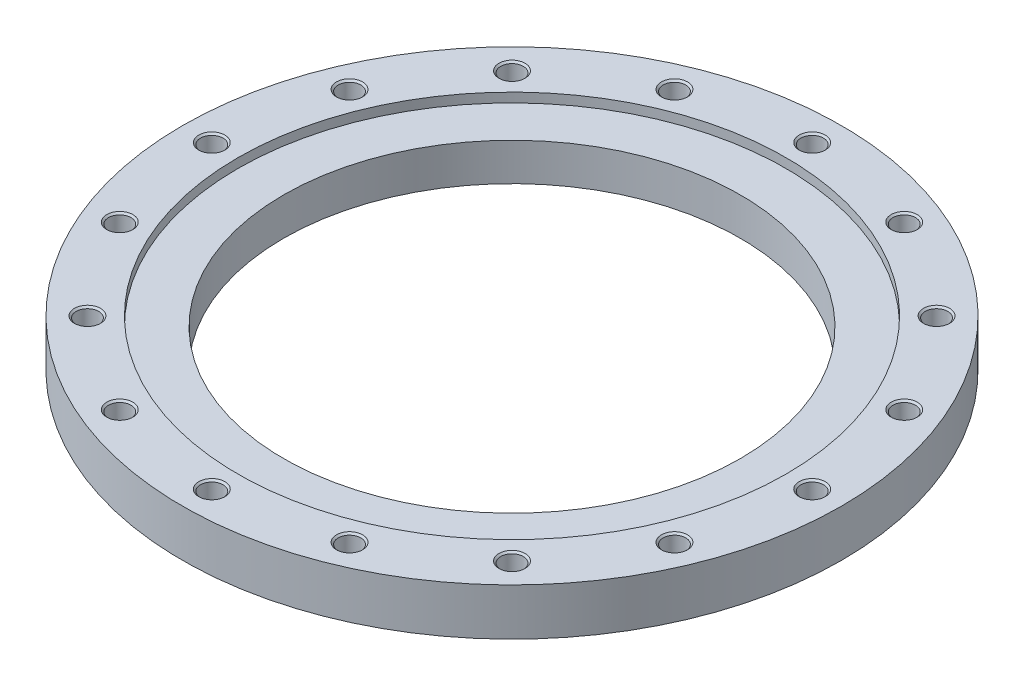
ISO-10303-21;
HEADER;
FILE_DESCRIPTION(('STEP AP214'),'2;1');
FILE_NAME('part.step','',(''),(''),'','','');
FILE_SCHEMA(('AUTOMOTIVE_DESIGN { 1 0 10303 214 1 1 1 1 }'));
ENDSEC;
DATA;
#1=APPLICATION_CONTEXT('core data for automotive mechanical design processes');
#2=APPLICATION_PROTOCOL_DEFINITION('international standard','automotive_design',2000,#1);
#3=PRODUCT_CONTEXT('',#1,'mechanical');
#4=PRODUCT('Part','Part','',(#3));
#5=PRODUCT_RELATED_PRODUCT_CATEGORY('part','',(#4));
#6=PRODUCT_DEFINITION_FORMATION('','',#4);
#7=PRODUCT_DEFINITION_CONTEXT('part definition',#1,'design');
#8=PRODUCT_DEFINITION('design','',#6,#7);
#9=PRODUCT_DEFINITION_SHAPE('','',#8);
#10=(LENGTH_UNIT() NAMED_UNIT(*) SI_UNIT(.MILLI.,.METRE.));
#11=(NAMED_UNIT(*) PLANE_ANGLE_UNIT() SI_UNIT($,.RADIAN.));
#12=(NAMED_UNIT(*) SI_UNIT($,.STERADIAN.) SOLID_ANGLE_UNIT());
#13=UNCERTAINTY_MEASURE_WITH_UNIT(LENGTH_MEASURE(1.E-05),#10,'distance_accuracy_value','');
#14=(GEOMETRIC_REPRESENTATION_CONTEXT(3) GLOBAL_UNCERTAINTY_ASSIGNED_CONTEXT((#13)) GLOBAL_UNIT_ASSIGNED_CONTEXT((#10,
#11,#12)) REPRESENTATION_CONTEXT('',''));
#15=CARTESIAN_POINT('',(0.,0.,0.));
#16=DIRECTION('',(0.,0.,1.));
#17=DIRECTION('',(1.,0.,0.));
#18=AXIS2_PLACEMENT_3D('',#15,#16,#17);
#19=CARTESIAN_POINT('',(0.,18.,0.));
#20=DIRECTION('',(0.,-1.,0.));
#21=DIRECTION('',(1.,0.,0.));
#22=AXIS2_PLACEMENT_3D('',#19,#20,#21);
#23=CYLINDRICAL_SURFACE('',#22,252.5);
#24=CARTESIAN_POINT('',(0.,0.,0.));
#25=DIRECTION('',(0.,1.,0.));
#26=DIRECTION('',(1.,0.,0.));
#27=AXIS2_PLACEMENT_3D('',#24,#25,#26);
#28=CIRCLE('',#27,252.5);
#29=CARTESIAN_POINT('',(252.5,0.,0.));
#30=VERTEX_POINT('',#29);
#31=EDGE_CURVE('E9',#30,#30,#28,.T.);
#32=ORIENTED_EDGE('',*,*,#31,.T.);
#33=EDGE_LOOP('',(#32));
#34=FACE_BOUND('',#33,.T.);
#35=CARTESIAN_POINT('',(0.,36.,0.));
#36=DIRECTION('',(0.,1.,0.));
#37=DIRECTION('',(1.,0.,0.));
#38=AXIS2_PLACEMENT_3D('',#35,#36,#37);
#39=CIRCLE('',#38,252.5);
#40=CARTESIAN_POINT('',(252.5,36.,0.));
#41=VERTEX_POINT('',#40);
#42=EDGE_CURVE('E564',#41,#41,#39,.T.);
#43=ORIENTED_EDGE('',*,*,#42,.F.);
#44=EDGE_LOOP('',(#43));
#45=FACE_BOUND('',#44,.T.);
#46=ADVANCED_FACE('F15',(#34,#45),#23,.T.);
#47=CARTESIAN_POINT('',(213.75,0.,0.));
#48=DIRECTION('',(0.,-1.,0.));
#49=DIRECTION('',(-1.,0.,0.));
#50=AXIS2_PLACEMENT_3D('',#47,#48,#49);
#51=PLANE('',#50);
#52=CARTESIAN_POINT('',(0.,0.,0.));
#53=DIRECTION('',(0.,1.,0.));
#54=DIRECTION('',(1.,0.,0.));
#55=AXIS2_PLACEMENT_3D('',#52,#53,#54);
#56=CIRCLE('',#55,175.);
#57=CARTESIAN_POINT('',(175.,0.,0.));
#58=VERTEX_POINT('',#57);
#59=EDGE_CURVE('E24',#58,#58,#56,.T.);
#60=ORIENTED_EDGE('',*,*,#59,.T.);
#61=EDGE_LOOP('',(#60));
#62=FACE_BOUND('',#61,.T.);
#63=ORIENTED_EDGE('',*,*,#31,.F.);
#64=EDGE_LOOP('',(#63));
#65=FACE_BOUND('',#64,.T.);
#66=ADVANCED_FACE('F381',(#62,#65),#51,.T.);
#67=CARTESIAN_POINT('',(0.,18.,0.));
#68=DIRECTION('',(0.,-1.,0.));
#69=DIRECTION('',(1.,0.,0.));
#70=AXIS2_PLACEMENT_3D('',#67,#68,#69);
#71=CYLINDRICAL_SURFACE('',#70,175.);
#72=ORIENTED_EDGE('',*,*,#59,.F.);
#73=EDGE_LOOP('',(#72));
#74=FACE_BOUND('',#73,.T.);
#75=CARTESIAN_POINT('',(0.,28.8,0.));
#76=DIRECTION('',(0.,1.,0.));
#77=DIRECTION('',(1.,0.,0.));
#78=AXIS2_PLACEMENT_3D('',#75,#76,#77);
#79=CIRCLE('',#78,175.);
#80=CARTESIAN_POINT('',(-175.,28.8,0.));
#81=VERTEX_POINT('',#80);
#82=EDGE_CURVE('E548',#81,#81,#79,.T.);
#83=ORIENTED_EDGE('',*,*,#82,.T.);
#84=EDGE_LOOP('',(#83));
#85=FACE_BOUND('',#84,.T.);
#86=ADVANCED_FACE('F17',(#74,#85),#71,.F.);
#87=CARTESIAN_POINT('',(213.75,36.,0.));
#88=DIRECTION('',(0.,1.,0.));
#89=DIRECTION('',(1.,0.,0.));
#90=AXIS2_PLACEMENT_3D('',#87,#88,#89);
#91=PLANE('',#90);
#92=ORIENTED_EDGE('',*,*,#42,.T.);
#93=EDGE_LOOP('',(#92));
#94=FACE_BOUND('',#93,.T.);
#95=CARTESIAN_POINT('',(0.,36.,0.));
#96=DIRECTION('',(0.,-1.,0.));
#97=DIRECTION('',(1.,0.,0.));
#98=AXIS2_PLACEMENT_3D('',#95,#96,#97);
#99=CIRCLE('',#98,210.);
#100=CARTESIAN_POINT('',(-210.,36.,0.));
#101=VERTEX_POINT('',#100);
#102=EDGE_CURVE('E543',#101,#101,#99,.T.);
#103=ORIENTED_EDGE('',*,*,#102,.T.);
#104=EDGE_LOOP('',(#103));
#105=FACE_BOUND('',#104,.T.);
#106=CARTESIAN_POINT('',(230.,36.,0.));
#107=DIRECTION('',(0.,-1.,0.));
#108=DIRECTION('',(1.,0.,0.));
#109=AXIS2_PLACEMENT_3D('',#106,#107,#108);
#110=CIRCLE('',#109,10.);
#111=CARTESIAN_POINT('',(240.,36.,0.));
#112=VERTEX_POINT('',#111);
#113=EDGE_CURVE('E561',#112,#112,#110,.T.);
#114=ORIENTED_EDGE('',*,*,#113,.T.);
#115=EDGE_LOOP('',(#114));
#116=FACE_BOUND('',#115,.T.);
#117=CARTESIAN_POINT('',(212.492292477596,36.,-88.0171894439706));
#118=DIRECTION('',(0.,-1.,0.));
#119=DIRECTION('',(0.923879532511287,0.,-0.38268343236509));
#120=AXIS2_PLACEMENT_3D('',#117,#118,#119);
#121=CIRCLE('',#120,10.);
#122=CARTESIAN_POINT('',(221.731087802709,36.,-91.8440237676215));
#123=VERTEX_POINT('',#122);
#124=EDGE_CURVE('E554',#123,#123,#121,.T.);
#125=ORIENTED_EDGE('',*,*,#124,.T.);
#126=EDGE_LOOP('',(#125));
#127=FACE_BOUND('',#126,.T.);
#128=CARTESIAN_POINT('',(162.634559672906,36.,-162.634559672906));
#129=DIRECTION('',(0.,-1.,0.));
#130=DIRECTION('',(0.707106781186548,0.,-0.707106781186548));
#131=AXIS2_PLACEMENT_3D('',#128,#129,#130);
#132=CIRCLE('',#131,10.);
#133=CARTESIAN_POINT('',(169.705627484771,36.,-169.705627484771));
#134=VERTEX_POINT('',#133);
#135=EDGE_CURVE('E690',#134,#134,#132,.T.);
#136=ORIENTED_EDGE('',*,*,#135,.T.);
#137=EDGE_LOOP('',(#136));
#138=FACE_BOUND('',#137,.T.);
#139=CARTESIAN_POINT('',(88.0171894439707,36.,-212.492292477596));
#140=DIRECTION('',(0.,-1.,0.));
#141=DIRECTION('',(0.38268343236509,0.,-0.923879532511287));
#142=AXIS2_PLACEMENT_3D('',#139,#140,#141);
#143=CIRCLE('',#142,10.);
#144=CARTESIAN_POINT('',(91.8440237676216,36.,-221.731087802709));
#145=VERTEX_POINT('',#144);
#146=EDGE_CURVE('E610',#145,#145,#143,.T.);
#147=ORIENTED_EDGE('',*,*,#146,.T.);
#148=EDGE_LOOP('',(#147));
#149=FACE_BOUND('',#148,.T.);
#150=CARTESIAN_POINT('',(0.,36.,-230.));
#151=DIRECTION('',(0.,-1.,0.));
#152=DIRECTION('',(0.,0.,-1.));
#153=AXIS2_PLACEMENT_3D('',#150,#151,#152);
#154=CIRCLE('',#153,10.);
#155=CARTESIAN_POINT('',(0.,36.,-240.));
#156=VERTEX_POINT('',#155);
#157=EDGE_CURVE('E673',#156,#156,#154,.T.);
#158=ORIENTED_EDGE('',*,*,#157,.T.);
#159=EDGE_LOOP('',(#158));
#160=FACE_BOUND('',#159,.T.);
#161=CARTESIAN_POINT('',(-88.0171894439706,36.,-212.492292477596));
#162=DIRECTION('',(0.,-1.,0.));
#163=DIRECTION('',(-0.38268343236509,0.,-0.923879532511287));
#164=AXIS2_PLACEMENT_3D('',#161,#162,#163);
#165=CIRCLE('',#164,10.);
#166=CARTESIAN_POINT('',(-91.8440237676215,36.,-221.731087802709));
#167=VERTEX_POINT('',#166);
#168=EDGE_CURVE('E642',#167,#167,#165,.T.);
#169=ORIENTED_EDGE('',*,*,#168,.T.);
#170=EDGE_LOOP('',(#169));
#171=FACE_BOUND('',#170,.T.);
#172=CARTESIAN_POINT('',(-162.634559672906,36.,-162.634559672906));
#173=DIRECTION('',(0.,-1.,0.));
#174=DIRECTION('',(-0.707106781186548,0.,-0.707106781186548));
#175=AXIS2_PLACEMENT_3D('',#172,#173,#174);
#176=CIRCLE('',#175,10.);
#177=CARTESIAN_POINT('',(-169.705627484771,36.,-169.705627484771));
#178=VERTEX_POINT('',#177);
#179=EDGE_CURVE('E616',#178,#178,#176,.T.);
#180=ORIENTED_EDGE('',*,*,#179,.T.);
#181=EDGE_LOOP('',(#180));
#182=FACE_BOUND('',#181,.T.);
#183=CARTESIAN_POINT('',(-212.492292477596,36.,-88.0171894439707));
#184=DIRECTION('',(0.,-1.,0.));
#185=DIRECTION('',(-0.923879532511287,0.,-0.38268343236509));
#186=AXIS2_PLACEMENT_3D('',#183,#184,#185);
#187=CIRCLE('',#186,10.);
#188=CARTESIAN_POINT('',(-221.731087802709,36.,-91.8440237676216));
#189=VERTEX_POINT('',#188);
#190=EDGE_CURVE('E655',#189,#189,#187,.T.);
#191=ORIENTED_EDGE('',*,*,#190,.T.);
#192=EDGE_LOOP('',(#191));
#193=FACE_BOUND('',#192,.T.);
#194=CARTESIAN_POINT('',(-230.,36.,0.));
#195=DIRECTION('',(0.,-1.,0.));
#196=DIRECTION('',(-1.,0.,0.));
#197=AXIS2_PLACEMENT_3D('',#194,#195,#196);
#198=CIRCLE('',#197,10.);
#199=CARTESIAN_POINT('',(-240.,36.,0.));
#200=VERTEX_POINT('',#199);
#201=EDGE_CURVE('E638',#200,#200,#198,.T.);
#202=ORIENTED_EDGE('',*,*,#201,.T.);
#203=EDGE_LOOP('',(#202));
#204=FACE_BOUND('',#203,.T.);
#205=CARTESIAN_POINT('',(-212.492292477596,36.,88.0171894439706));
#206=DIRECTION('',(0.,-1.,0.));
#207=DIRECTION('',(-0.923879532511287,0.,0.38268343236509));
#208=AXIS2_PLACEMENT_3D('',#205,#206,#207);
#209=CIRCLE('',#208,10.);
#210=CARTESIAN_POINT('',(-221.731087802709,36.,91.8440237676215));
#211=VERTEX_POINT('',#210);
#212=EDGE_CURVE('E615',#211,#211,#209,.T.);
#213=ORIENTED_EDGE('',*,*,#212,.T.);
#214=EDGE_LOOP('',(#213));
#215=FACE_BOUND('',#214,.T.);
#216=CARTESIAN_POINT('',(-162.634559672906,36.,162.634559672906));
#217=DIRECTION('',(0.,-1.,0.));
#218=DIRECTION('',(-0.707106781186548,0.,0.707106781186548));
#219=AXIS2_PLACEMENT_3D('',#216,#217,#218);
#220=CIRCLE('',#219,10.);
#221=CARTESIAN_POINT('',(-169.705627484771,36.,169.705627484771));
#222=VERTEX_POINT('',#221);
#223=EDGE_CURVE('E590',#222,#222,#220,.T.);
#224=ORIENTED_EDGE('',*,*,#223,.T.);
#225=EDGE_LOOP('',(#224));
#226=FACE_BOUND('',#225,.T.);
#227=CARTESIAN_POINT('',(-88.0171894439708,36.,212.492292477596));
#228=DIRECTION('',(0.,-1.,0.));
#229=DIRECTION('',(-0.382683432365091,0.,0.923879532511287));
#230=AXIS2_PLACEMENT_3D('',#227,#228,#229);
#231=CIRCLE('',#230,10.);
#232=CARTESIAN_POINT('',(-91.8440237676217,36.,221.731087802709));
#233=VERTEX_POINT('',#232);
#234=EDGE_CURVE('E575',#233,#233,#231,.T.);
#235=ORIENTED_EDGE('',*,*,#234,.T.);
#236=EDGE_LOOP('',(#235));
#237=FACE_BOUND('',#236,.T.);
#238=CARTESIAN_POINT('',(0.,36.,230.));
#239=DIRECTION('',(0.,-1.,0.));
#240=DIRECTION('',(0.,0.,1.));
#241=AXIS2_PLACEMENT_3D('',#238,#239,#240);
#242=CIRCLE('',#241,10.);
#243=CARTESIAN_POINT('',(0.,36.,240.));
#244=VERTEX_POINT('',#243);
#245=EDGE_CURVE('E718',#244,#244,#242,.T.);
#246=ORIENTED_EDGE('',*,*,#245,.T.);
#247=EDGE_LOOP('',(#246));
#248=FACE_BOUND('',#247,.T.);
#249=CARTESIAN_POINT('',(88.0171894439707,36.,212.492292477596));
#250=DIRECTION('',(0.,-1.,0.));
#251=DIRECTION('',(0.38268343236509,0.,0.923879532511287));
#252=AXIS2_PLACEMENT_3D('',#249,#250,#251);
#253=CIRCLE('',#252,10.);
#254=CARTESIAN_POINT('',(91.8440237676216,36.,221.731087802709));
#255=VERTEX_POINT('',#254);
#256=EDGE_CURVE('E710',#255,#255,#253,.T.);
#257=ORIENTED_EDGE('',*,*,#256,.T.);
#258=EDGE_LOOP('',(#257));
#259=FACE_BOUND('',#258,.T.);
#260=CARTESIAN_POINT('',(162.634559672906,36.,162.634559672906));
#261=DIRECTION('',(0.,-1.,0.));
#262=DIRECTION('',(0.707106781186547,0.,0.707106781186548));
#263=AXIS2_PLACEMENT_3D('',#260,#261,#262);
#264=CIRCLE('',#263,10.);
#265=CARTESIAN_POINT('',(169.705627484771,36.,169.705627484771));
#266=VERTEX_POINT('',#265);
#267=EDGE_CURVE('E801',#266,#266,#264,.T.);
#268=ORIENTED_EDGE('',*,*,#267,.T.);
#269=EDGE_LOOP('',(#268));
#270=FACE_BOUND('',#269,.T.);
#271=CARTESIAN_POINT('',(212.492292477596,36.,88.0171894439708));
#272=DIRECTION('',(0.,-1.,0.));
#273=DIRECTION('',(0.923879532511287,0.,0.382683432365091));
#274=AXIS2_PLACEMENT_3D('',#271,#272,#273);
#275=CIRCLE('',#274,10.);
#276=CARTESIAN_POINT('',(221.731087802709,36.,91.8440237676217));
#277=VERTEX_POINT('',#276);
#278=EDGE_CURVE('E806',#277,#277,#275,.T.);
#279=ORIENTED_EDGE('',*,*,#278,.T.);
#280=EDGE_LOOP('',(#279));
#281=FACE_BOUND('',#280,.T.);
#282=ADVANCED_FACE('F535',(#94,#105,#116,#127,#138,#149,#160,#171,#182,#193,#204,#215,#226,#237,
#248,#259,#270,#281),#91,.T.);
#283=CARTESIAN_POINT('',(0.,28.8,0.));
#284=DIRECTION('',(0.,-1.,0.));
#285=DIRECTION('',(-1.,0.,0.));
#286=AXIS2_PLACEMENT_3D('',#283,#284,#285);
#287=PLANE('',#286);
#288=CARTESIAN_POINT('',(0.,28.8,0.));
#289=DIRECTION('',(0.,-1.,0.));
#290=DIRECTION('',(1.,0.,0.));
#291=AXIS2_PLACEMENT_3D('',#288,#289,#290);
#292=CIRCLE('',#291,210.);
#293=CARTESIAN_POINT('',(210.,28.8,0.));
#294=VERTEX_POINT('',#293);
#295=EDGE_CURVE('E540',#294,#294,#292,.T.);
#296=ORIENTED_EDGE('',*,*,#295,.F.);
#297=EDGE_LOOP('',(#296));
#298=FACE_BOUND('',#297,.T.);
#299=ORIENTED_EDGE('',*,*,#82,.F.);
#300=EDGE_LOOP('',(#299));
#301=FACE_BOUND('',#300,.T.);
#302=ADVANCED_FACE('F530',(#298,#301),#287,.F.);
#303=CARTESIAN_POINT('',(0.,34.2,0.));
#304=DIRECTION('',(0.,-1.,0.));
#305=DIRECTION('',(1.,0.,0.));
#306=AXIS2_PLACEMENT_3D('',#303,#304,#305);
#307=CYLINDRICAL_SURFACE('',#306,210.);
#308=ORIENTED_EDGE('',*,*,#295,.T.);
#309=EDGE_LOOP('',(#308));
#310=FACE_BOUND('',#309,.T.);
#311=ORIENTED_EDGE('',*,*,#102,.F.);
#312=EDGE_LOOP('',(#311));
#313=FACE_BOUND('',#312,.T.);
#314=ADVANCED_FACE('F527',(#310,#313),#307,.F.);
#315=CARTESIAN_POINT('',(230.,5.50386219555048,0.));
#316=DIRECTION('',(0.,1.,0.));
#317=DIRECTION('',(1.,0.,0.));
#318=AXIS2_PLACEMENT_3D('',#315,#316,#317);
#319=CONICAL_SURFACE('',#318,4.3234375,1.0471975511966);
#320=CARTESIAN_POINT('',(230.,8.,0.));
#321=DIRECTION('',(0.,-1.,0.));
#322=DIRECTION('',(1.,0.,0.));
#323=AXIS2_PLACEMENT_3D('',#320,#321,#322);
#324=CIRCLE('',#323,8.646875);
#325=CARTESIAN_POINT('',(238.646875,8.,0.));
#326=VERTEX_POINT('',#325);
#327=EDGE_CURVE('E546',#326,#326,#324,.T.);
#328=ORIENTED_EDGE('',*,*,#327,.F.);
#329=EDGE_LOOP('',(#328));
#330=FACE_BOUND('',#329,.T.);
#331=CARTESIAN_POINT('',(230.,3.00772439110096,0.));
#332=VERTEX_POINT('',#331);
#333=VERTEX_LOOP('',#332);
#334=FACE_BOUND('',#333,.T.);
#335=ADVANCED_FACE('F524',(#330,#334),#319,.F.);
#336=CARTESIAN_POINT('',(230.,11.3234375,0.));
#337=DIRECTION('',(0.,1.,0.));
#338=DIRECTION('',(1.,0.,0.));
#339=AXIS2_PLACEMENT_3D('',#336,#337,#338);
#340=CYLINDRICAL_SURFACE('',#339,8.646875);
#341=CARTESIAN_POINT('',(230.,14.646875,0.));
#342=DIRECTION('',(0.,-1.,0.));
#343=DIRECTION('',(1.,0.,0.));
#344=AXIS2_PLACEMENT_3D('',#341,#342,#343);
#345=CIRCLE('',#344,8.646875);
#346=CARTESIAN_POINT('',(238.646875,14.646875,0.));
#347=VERTEX_POINT('',#346);
#348=EDGE_CURVE('E550',#347,#347,#345,.T.);
#349=ORIENTED_EDGE('',*,*,#348,.F.);
#350=EDGE_LOOP('',(#349));
#351=FACE_BOUND('',#350,.T.);
#352=ORIENTED_EDGE('',*,*,#327,.T.);
#353=EDGE_LOOP('',(#352));
#354=FACE_BOUND('',#353,.T.);
#355=ADVANCED_FACE('F526',(#351,#354),#340,.F.);
#356=CARTESIAN_POINT('',(230.,15.3234375,0.));
#357=DIRECTION('',(0.,1.,0.));
#358=DIRECTION('',(1.,0.,0.));
#359=AXIS2_PLACEMENT_3D('',#356,#357,#358);
#360=CONICAL_SURFACE('',#359,9.3234375,0.785398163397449);
#361=CARTESIAN_POINT('',(230.,16.,0.));
#362=DIRECTION('',(0.,-1.,0.));
#363=DIRECTION('',(1.,0.,0.));
#364=AXIS2_PLACEMENT_3D('',#361,#362,#363);
#365=CIRCLE('',#364,10.);
#366=CARTESIAN_POINT('',(240.,16.,0.));
#367=VERTEX_POINT('',#366);
#368=EDGE_CURVE('E582',#367,#367,#365,.T.);
#369=ORIENTED_EDGE('',*,*,#368,.F.);
#370=EDGE_LOOP('',(#369));
#371=FACE_BOUND('',#370,.T.);
#372=ORIENTED_EDGE('',*,*,#348,.T.);
#373=EDGE_LOOP('',(#372));
#374=FACE_BOUND('',#373,.T.);
#375=ADVANCED_FACE('F777',(#371,#374),#360,.F.);
#376=CARTESIAN_POINT('',(239.3234375,16.,0.));
#377=DIRECTION('',(0.,1.,0.));
#378=DIRECTION('',(-1.,0.,0.));
#379=AXIS2_PLACEMENT_3D('',#376,#377,#378);
#380=PLANE('',#379);
#381=CARTESIAN_POINT('',(230.,16.,0.));
#382=DIRECTION('',(0.,-1.,0.));
#383=DIRECTION('',(1.,0.,0.));
#384=AXIS2_PLACEMENT_3D('',#381,#382,#383);
#385=CIRCLE('',#384,8.646875);
#386=CARTESIAN_POINT('',(238.646875,16.,0.));
#387=VERTEX_POINT('',#386);
#388=EDGE_CURVE('E563',#387,#387,#385,.T.);
#389=ORIENTED_EDGE('',*,*,#388,.F.);
#390=EDGE_LOOP('',(#389));
#391=FACE_BOUND('',#390,.T.);
#392=ORIENTED_EDGE('',*,*,#368,.T.);
#393=EDGE_LOOP('',(#392));
#394=FACE_BOUND('',#393,.T.);
#395=ADVANCED_FACE('F865',(#391,#394),#380,.F.);
#396=CARTESIAN_POINT('',(230.,25.3234375,0.));
#397=DIRECTION('',(0.,1.,0.));
#398=DIRECTION('',(1.,0.,0.));
#399=AXIS2_PLACEMENT_3D('',#396,#397,#398);
#400=CYLINDRICAL_SURFACE('',#399,8.646875);
#401=CARTESIAN_POINT('',(230.,34.646875,0.));
#402=DIRECTION('',(0.,-1.,0.));
#403=DIRECTION('',(1.,0.,0.));
#404=AXIS2_PLACEMENT_3D('',#401,#402,#403);
#405=CIRCLE('',#404,8.646875);
#406=CARTESIAN_POINT('',(238.646875,34.646875,0.));
#407=VERTEX_POINT('',#406);
#408=EDGE_CURVE('E559',#407,#407,#405,.T.);
#409=ORIENTED_EDGE('',*,*,#408,.F.);
#410=EDGE_LOOP('',(#409));
#411=FACE_BOUND('',#410,.T.);
#412=ORIENTED_EDGE('',*,*,#388,.T.);
#413=EDGE_LOOP('',(#412));
#414=FACE_BOUND('',#413,.T.);
#415=ADVANCED_FACE('F374',(#411,#414),#400,.F.);
#416=CARTESIAN_POINT('',(230.,35.3234375,0.));
#417=DIRECTION('',(0.,1.,0.));
#418=DIRECTION('',(1.,0.,0.));
#419=AXIS2_PLACEMENT_3D('',#416,#417,#418);
#420=CONICAL_SURFACE('',#419,9.3234375,0.785398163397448);
#421=ORIENTED_EDGE('',*,*,#113,.F.);
#422=EDGE_LOOP('',(#421));
#423=FACE_BOUND('',#422,.T.);
#424=ORIENTED_EDGE('',*,*,#408,.T.);
#425=EDGE_LOOP('',(#424));
#426=FACE_BOUND('',#425,.T.);
#427=ADVANCED_FACE('F363',(#423,#426),#420,.F.);
#428=CARTESIAN_POINT('',(212.492292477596,5.50386219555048,-88.0171894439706));
#429=DIRECTION('',(0.,1.,0.));
#430=DIRECTION('',(0.923879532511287,0.,-0.38268343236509));
#431=AXIS2_PLACEMENT_3D('',#428,#429,#430);
#432=CONICAL_SURFACE('',#431,4.3234375,1.0471975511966);
#433=CARTESIAN_POINT('',(212.492292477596,8.,-88.0171894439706));
#434=DIRECTION('',(0.,-1.,0.));
#435=DIRECTION('',(0.923879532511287,0.,-0.38268343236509));
#436=AXIS2_PLACEMENT_3D('',#433,#434,#435);
#437=CIRCLE('',#436,8.646875);
#438=CARTESIAN_POINT('',(220.480963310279,8.,-91.3262052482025));
#439=VERTEX_POINT('',#438);
#440=EDGE_CURVE('E562',#439,#439,#437,.T.);
#441=ORIENTED_EDGE('',*,*,#440,.F.);
#442=EDGE_LOOP('',(#441));
#443=FACE_BOUND('',#442,.T.);
#444=CARTESIAN_POINT('',(212.492292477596,3.00772439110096,-88.0171894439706));
#445=VERTEX_POINT('',#444);
#446=VERTEX_LOOP('',#445);
#447=FACE_BOUND('',#446,.T.);
#448=ADVANCED_FACE('F360',(#443,#447),#432,.F.);
#449=CARTESIAN_POINT('',(212.492292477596,11.3234375,-88.0171894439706));
#450=DIRECTION('',(0.,1.,0.));
#451=DIRECTION('',(0.923879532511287,0.,-0.38268343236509));
#452=AXIS2_PLACEMENT_3D('',#449,#450,#451);
#453=CYLINDRICAL_SURFACE('',#452,8.646875);
#454=CARTESIAN_POINT('',(212.492292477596,14.646875,-88.0171894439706));
#455=DIRECTION('',(0.,-1.,0.));
#456=DIRECTION('',(0.923879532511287,0.,-0.38268343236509));
#457=AXIS2_PLACEMENT_3D('',#454,#455,#456);
#458=CIRCLE('',#457,8.646875);
#459=CARTESIAN_POINT('',(220.480963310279,14.646875,-91.3262052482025));
#460=VERTEX_POINT('',#459);
#461=EDGE_CURVE('E626',#460,#460,#458,.T.);
#462=ORIENTED_EDGE('',*,*,#461,.F.);
#463=EDGE_LOOP('',(#462));
#464=FACE_BOUND('',#463,.T.);
#465=ORIENTED_EDGE('',*,*,#440,.T.);
#466=EDGE_LOOP('',(#465));
#467=FACE_BOUND('',#466,.T.);
#468=ADVANCED_FACE('F362',(#464,#467),#453,.F.);
#469=CARTESIAN_POINT('',(212.492292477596,15.3234375,-88.0171894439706));
#470=DIRECTION('',(0.,1.,0.));
#471=DIRECTION('',(0.923879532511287,0.,-0.38268343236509));
#472=AXIS2_PLACEMENT_3D('',#469,#470,#471);
#473=CONICAL_SURFACE('',#472,9.3234375,0.785398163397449);
#474=CARTESIAN_POINT('',(212.492292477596,16.,-88.0171894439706));
#475=DIRECTION('',(0.,-1.,0.));
#476=DIRECTION('',(0.923879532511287,0.,-0.38268343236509));
#477=AXIS2_PLACEMENT_3D('',#474,#475,#476);
#478=CIRCLE('',#477,10.);
#479=CARTESIAN_POINT('',(221.731087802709,16.,-91.8440237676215));
#480=VERTEX_POINT('',#479);
#481=EDGE_CURVE('E558',#480,#480,#478,.T.);
#482=ORIENTED_EDGE('',*,*,#481,.F.);
#483=EDGE_LOOP('',(#482));
#484=FACE_BOUND('',#483,.T.);
#485=ORIENTED_EDGE('',*,*,#461,.T.);
#486=EDGE_LOOP('',(#485));
#487=FACE_BOUND('',#486,.T.);
#488=ADVANCED_FACE('F371',(#484,#487),#473,.F.);
#489=CARTESIAN_POINT('',(221.106025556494,16.,-91.585114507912));
#490=DIRECTION('',(0.,1.,0.));
#491=DIRECTION('',(-0.923879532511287,0.,0.38268343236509));
#492=AXIS2_PLACEMENT_3D('',#489,#490,#491);
#493=PLANE('',#492);
#494=CARTESIAN_POINT('',(212.492292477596,16.,-88.0171894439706));
#495=DIRECTION('',(0.,-1.,0.));
#496=DIRECTION('',(0.923879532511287,0.,-0.38268343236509));
#497=AXIS2_PLACEMENT_3D('',#494,#495,#496);
#498=CIRCLE('',#497,8.646875);
#499=CARTESIAN_POINT('',(220.480963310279,16.,-91.3262052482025));
#500=VERTEX_POINT('',#499);
#501=EDGE_CURVE('E556',#500,#500,#498,.T.);
#502=ORIENTED_EDGE('',*,*,#501,.F.);
#503=EDGE_LOOP('',(#502));
#504=FACE_BOUND('',#503,.T.);
#505=ORIENTED_EDGE('',*,*,#481,.T.);
#506=EDGE_LOOP('',(#505));
#507=FACE_BOUND('',#506,.T.);
#508=ADVANCED_FACE('F519',(#504,#507),#493,.F.);
#509=CARTESIAN_POINT('',(212.492292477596,25.3234375,-88.0171894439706));
#510=DIRECTION('',(0.,1.,0.));
#511=DIRECTION('',(0.923879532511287,0.,-0.38268343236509));
#512=AXIS2_PLACEMENT_3D('',#509,#510,#511);
#513=CYLINDRICAL_SURFACE('',#512,8.646875);
#514=CARTESIAN_POINT('',(212.492292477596,34.646875,-88.0171894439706));
#515=DIRECTION('',(0.,-1.,0.));
#516=DIRECTION('',(0.923879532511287,0.,-0.38268343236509));
#517=AXIS2_PLACEMENT_3D('',#514,#515,#516);
#518=CIRCLE('',#517,8.646875);
#519=CARTESIAN_POINT('',(220.480963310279,34.646875,-91.3262052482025));
#520=VERTEX_POINT('',#519);
#521=EDGE_CURVE('E695',#520,#520,#518,.T.);
#522=ORIENTED_EDGE('',*,*,#521,.F.);
#523=EDGE_LOOP('',(#522));
#524=FACE_BOUND('',#523,.T.);
#525=ORIENTED_EDGE('',*,*,#501,.T.);
#526=EDGE_LOOP('',(#525));
#527=FACE_BOUND('',#526,.T.);
#528=ADVANCED_FACE('F515',(#524,#527),#513,.F.);
#529=CARTESIAN_POINT('',(212.492292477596,35.3234375,-88.0171894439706));
#530=DIRECTION('',(0.,1.,0.));
#531=DIRECTION('',(0.923879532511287,0.,-0.38268343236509));
#532=AXIS2_PLACEMENT_3D('',#529,#530,#531);
#533=CONICAL_SURFACE('',#532,9.3234375,0.785398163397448);
#534=ORIENTED_EDGE('',*,*,#124,.F.);
#535=EDGE_LOOP('',(#534));
#536=FACE_BOUND('',#535,.T.);
#537=ORIENTED_EDGE('',*,*,#521,.T.);
#538=EDGE_LOOP('',(#537));
#539=FACE_BOUND('',#538,.T.);
#540=ADVANCED_FACE('F511',(#536,#539),#533,.F.);
#541=CARTESIAN_POINT('',(162.634559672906,5.50386219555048,-162.634559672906));
#542=DIRECTION('',(0.,1.,0.));
#543=DIRECTION('',(0.707106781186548,0.,-0.707106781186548));
#544=AXIS2_PLACEMENT_3D('',#541,#542,#543);
#545=CONICAL_SURFACE('',#544,4.3234375,1.0471975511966);
#546=CARTESIAN_POINT('',(162.634559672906,8.,-162.634559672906));
#547=DIRECTION('',(0.,-1.,0.));
#548=DIRECTION('',(0.707106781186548,0.,-0.707106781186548));
#549=AXIS2_PLACEMENT_3D('',#546,#547,#548);
#550=CIRCLE('',#549,8.646875);
#551=CARTESIAN_POINT('',(168.748823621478,8.,-168.748823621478));
#552=VERTEX_POINT('',#551);
#553=EDGE_CURVE('E696',#552,#552,#550,.T.);
#554=ORIENTED_EDGE('',*,*,#553,.F.);
#555=EDGE_LOOP('',(#554));
#556=FACE_BOUND('',#555,.T.);
#557=CARTESIAN_POINT('',(162.634559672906,3.00772439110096,-162.634559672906));
#558=VERTEX_POINT('',#557);
#559=VERTEX_LOOP('',#558);
#560=FACE_BOUND('',#559,.T.);
#561=ADVANCED_FACE('F507',(#556,#560),#545,.F.);
#562=CARTESIAN_POINT('',(162.634559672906,11.3234375,-162.634559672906));
#563=DIRECTION('',(0.,1.,0.));
#564=DIRECTION('',(0.707106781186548,0.,-0.707106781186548));
#565=AXIS2_PLACEMENT_3D('',#562,#563,#564);
#566=CYLINDRICAL_SURFACE('',#565,8.646875);
#567=CARTESIAN_POINT('',(162.634559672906,14.646875,-162.634559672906));
#568=DIRECTION('',(0.,-1.,0.));
#569=DIRECTION('',(0.707106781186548,0.,-0.707106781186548));
#570=AXIS2_PLACEMENT_3D('',#567,#568,#569);
#571=CIRCLE('',#570,8.646875);
#572=CARTESIAN_POINT('',(168.748823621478,14.646875,-168.748823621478));
#573=VERTEX_POINT('',#572);
#574=EDGE_CURVE('E694',#573,#573,#571,.T.);
#575=ORIENTED_EDGE('',*,*,#574,.F.);
#576=EDGE_LOOP('',(#575));
#577=FACE_BOUND('',#576,.T.);
#578=ORIENTED_EDGE('',*,*,#553,.T.);
#579=EDGE_LOOP('',(#578));
#580=FACE_BOUND('',#579,.T.);
#581=ADVANCED_FACE('F503',(#577,#580),#566,.F.);
#582=CARTESIAN_POINT('',(162.634559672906,15.3234375,-162.634559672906));
#583=DIRECTION('',(0.,1.,0.));
#584=DIRECTION('',(0.707106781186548,0.,-0.707106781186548));
#585=AXIS2_PLACEMENT_3D('',#582,#583,#584);
#586=CONICAL_SURFACE('',#585,9.3234375,0.785398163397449);
#587=CARTESIAN_POINT('',(162.634559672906,16.,-162.634559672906));
#588=DIRECTION('',(0.,-1.,0.));
#589=DIRECTION('',(0.707106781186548,0.,-0.707106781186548));
#590=AXIS2_PLACEMENT_3D('',#587,#588,#589);
#591=CIRCLE('',#590,10.);
#592=CARTESIAN_POINT('',(169.705627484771,16.,-169.705627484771));
#593=VERTEX_POINT('',#592);
#594=EDGE_CURVE('E693',#593,#593,#591,.T.);
#595=ORIENTED_EDGE('',*,*,#594,.F.);
#596=EDGE_LOOP('',(#595));
#597=FACE_BOUND('',#596,.T.);
#598=ORIENTED_EDGE('',*,*,#574,.T.);
#599=EDGE_LOOP('',(#598));
#600=FACE_BOUND('',#599,.T.);
#601=ADVANCED_FACE('F499',(#597,#600),#586,.F.);
#602=CARTESIAN_POINT('',(169.227225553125,16.,-169.227225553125));
#603=DIRECTION('',(0.,1.,0.));
#604=DIRECTION('',(-0.707106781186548,0.,0.707106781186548));
#605=AXIS2_PLACEMENT_3D('',#602,#603,#604);
#606=PLANE('',#605);
#607=CARTESIAN_POINT('',(162.634559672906,16.,-162.634559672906));
#608=DIRECTION('',(0.,-1.,0.));
#609=DIRECTION('',(0.707106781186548,0.,-0.707106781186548));
#610=AXIS2_PLACEMENT_3D('',#607,#608,#609);
#611=CIRCLE('',#610,8.646875);
#612=CARTESIAN_POINT('',(168.748823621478,16.,-168.748823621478));
#613=VERTEX_POINT('',#612);
#614=EDGE_CURVE('E692',#613,#613,#611,.T.);
#615=ORIENTED_EDGE('',*,*,#614,.F.);
#616=EDGE_LOOP('',(#615));
#617=FACE_BOUND('',#616,.T.);
#618=ORIENTED_EDGE('',*,*,#594,.T.);
#619=EDGE_LOOP('',(#618));
#620=FACE_BOUND('',#619,.T.);
#621=ADVANCED_FACE('F495',(#617,#620),#606,.F.);
#622=CARTESIAN_POINT('',(162.634559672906,25.3234375,-162.634559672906));
#623=DIRECTION('',(0.,1.,0.));
#624=DIRECTION('',(0.707106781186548,0.,-0.707106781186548));
#625=AXIS2_PLACEMENT_3D('',#622,#623,#624);
#626=CYLINDRICAL_SURFACE('',#625,8.646875);
#627=CARTESIAN_POINT('',(162.634559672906,34.646875,-162.634559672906));
#628=DIRECTION('',(0.,-1.,0.));
#629=DIRECTION('',(0.707106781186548,0.,-0.707106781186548));
#630=AXIS2_PLACEMENT_3D('',#627,#628,#629);
#631=CIRCLE('',#630,8.646875);
#632=CARTESIAN_POINT('',(168.748823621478,34.646875,-168.748823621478));
#633=VERTEX_POINT('',#632);
#634=EDGE_CURVE('E688',#633,#633,#631,.T.);
#635=ORIENTED_EDGE('',*,*,#634,.F.);
#636=EDGE_LOOP('',(#635));
#637=FACE_BOUND('',#636,.T.);
#638=ORIENTED_EDGE('',*,*,#614,.T.);
#639=EDGE_LOOP('',(#638));
#640=FACE_BOUND('',#639,.T.);
#641=ADVANCED_FACE('F492',(#637,#640),#626,.F.);
#642=CARTESIAN_POINT('',(162.634559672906,35.3234375,-162.634559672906));
#643=DIRECTION('',(0.,1.,0.));
#644=DIRECTION('',(0.707106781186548,0.,-0.707106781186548));
#645=AXIS2_PLACEMENT_3D('',#642,#643,#644);
#646=CONICAL_SURFACE('',#645,9.3234375,0.785398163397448);
#647=ORIENTED_EDGE('',*,*,#135,.F.);
#648=EDGE_LOOP('',(#647));
#649=FACE_BOUND('',#648,.T.);
#650=ORIENTED_EDGE('',*,*,#634,.T.);
#651=EDGE_LOOP('',(#650));
#652=FACE_BOUND('',#651,.T.);
#653=ADVANCED_FACE('F490',(#649,#652),#646,.F.);
#654=CARTESIAN_POINT('',(88.0171894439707,5.50386219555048,-212.492292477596));
#655=DIRECTION('',(0.,1.,0.));
#656=DIRECTION('',(0.38268343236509,0.,-0.923879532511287));
#657=AXIS2_PLACEMENT_3D('',#654,#655,#656);
#658=CONICAL_SURFACE('',#657,4.3234375,1.0471975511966);
#659=CARTESIAN_POINT('',(88.0171894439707,8.,-212.492292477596));
#660=DIRECTION('',(0.,-1.,0.));
#661=DIRECTION('',(0.38268343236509,0.,-0.923879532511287));
#662=AXIS2_PLACEMENT_3D('',#659,#660,#661);
#663=CIRCLE('',#662,8.646875);
#664=CARTESIAN_POINT('',(91.3262052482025,8.,-220.480963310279));
#665=VERTEX_POINT('',#664);
#666=EDGE_CURVE('E686',#665,#665,#663,.T.);
#667=ORIENTED_EDGE('',*,*,#666,.F.);
#668=EDGE_LOOP('',(#667));
#669=FACE_BOUND('',#668,.T.);
#670=CARTESIAN_POINT('',(88.0171894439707,3.00772439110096,-212.492292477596));
#671=VERTEX_POINT('',#670);
#672=VERTEX_LOOP('',#671);
#673=FACE_BOUND('',#672,.T.);
#674=ADVANCED_FACE('F487',(#669,#673),#658,.F.);
#675=CARTESIAN_POINT('',(88.0171894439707,11.3234375,-212.492292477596));
#676=DIRECTION('',(0.,1.,0.));
#677=DIRECTION('',(0.38268343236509,0.,-0.923879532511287));
#678=AXIS2_PLACEMENT_3D('',#675,#676,#677);
#679=CYLINDRICAL_SURFACE('',#678,8.646875);
#680=CARTESIAN_POINT('',(88.0171894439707,14.646875,-212.492292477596));
#681=DIRECTION('',(0.,-1.,0.));
#682=DIRECTION('',(0.38268343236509,0.,-0.923879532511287));
#683=AXIS2_PLACEMENT_3D('',#680,#681,#682);
#684=CIRCLE('',#683,8.646875);
#685=CARTESIAN_POINT('',(91.3262052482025,14.646875,-220.480963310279));
#686=VERTEX_POINT('',#685);
#687=EDGE_CURVE('E684',#686,#686,#684,.T.);
#688=ORIENTED_EDGE('',*,*,#687,.F.);
#689=EDGE_LOOP('',(#688));
#690=FACE_BOUND('',#689,.T.);
#691=ORIENTED_EDGE('',*,*,#666,.T.);
#692=EDGE_LOOP('',(#691));
#693=FACE_BOUND('',#692,.T.);
#694=ADVANCED_FACE('F485',(#690,#693),#679,.F.);
#695=CARTESIAN_POINT('',(88.0171894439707,15.3234375,-212.492292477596));
#696=DIRECTION('',(0.,1.,0.));
#697=DIRECTION('',(0.38268343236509,0.,-0.923879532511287));
#698=AXIS2_PLACEMENT_3D('',#695,#696,#697);
#699=CONICAL_SURFACE('',#698,9.3234375,0.785398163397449);
#700=CARTESIAN_POINT('',(88.0171894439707,16.,-212.492292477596));
#701=DIRECTION('',(0.,-1.,0.));
#702=DIRECTION('',(0.38268343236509,0.,-0.923879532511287));
#703=AXIS2_PLACEMENT_3D('',#700,#701,#702);
#704=CIRCLE('',#703,10.);
#705=CARTESIAN_POINT('',(91.8440237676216,16.,-221.731087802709));
#706=VERTEX_POINT('',#705);
#707=EDGE_CURVE('E681',#706,#706,#704,.T.);
#708=ORIENTED_EDGE('',*,*,#707,.F.);
#709=EDGE_LOOP('',(#708));
#710=FACE_BOUND('',#709,.T.);
#711=ORIENTED_EDGE('',*,*,#687,.T.);
#712=EDGE_LOOP('',(#711));
#713=FACE_BOUND('',#712,.T.);
#714=ADVANCED_FACE('F481',(#710,#713),#699,.F.);
#715=CARTESIAN_POINT('',(91.5851145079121,16.,-221.106025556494));
#716=DIRECTION('',(0.,1.,0.));
#717=DIRECTION('',(-0.38268343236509,0.,0.923879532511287));
#718=AXIS2_PLACEMENT_3D('',#715,#716,#717);
#719=PLANE('',#718);
#720=CARTESIAN_POINT('',(88.0171894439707,16.,-212.492292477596));
#721=DIRECTION('',(0.,-1.,0.));
#722=DIRECTION('',(0.38268343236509,0.,-0.923879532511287));
#723=AXIS2_PLACEMENT_3D('',#720,#721,#722);
#724=CIRCLE('',#723,8.646875);
#725=CARTESIAN_POINT('',(91.3262052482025,16.,-220.480963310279));
#726=VERTEX_POINT('',#725);
#727=EDGE_CURVE('E612',#726,#726,#724,.T.);
#728=ORIENTED_EDGE('',*,*,#727,.F.);
#729=EDGE_LOOP('',(#728));
#730=FACE_BOUND('',#729,.T.);
#731=ORIENTED_EDGE('',*,*,#707,.T.);
#732=EDGE_LOOP('',(#731));
#733=FACE_BOUND('',#732,.T.);
#734=ADVANCED_FACE('F477',(#730,#733),#719,.F.);
#735=CARTESIAN_POINT('',(88.0171894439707,25.3234375,-212.492292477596));
#736=DIRECTION('',(0.,1.,0.));
#737=DIRECTION('',(0.38268343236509,0.,-0.923879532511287));
#738=AXIS2_PLACEMENT_3D('',#735,#736,#737);
#739=CYLINDRICAL_SURFACE('',#738,8.646875);
#740=CARTESIAN_POINT('',(88.0171894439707,34.646875,-212.492292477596));
#741=DIRECTION('',(0.,-1.,0.));
#742=DIRECTION('',(0.38268343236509,0.,-0.923879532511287));
#743=AXIS2_PLACEMENT_3D('',#740,#741,#742);
#744=CIRCLE('',#743,8.646875);
#745=CARTESIAN_POINT('',(91.3262052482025,34.646875,-220.480963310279));
#746=VERTEX_POINT('',#745);
#747=EDGE_CURVE('E613',#746,#746,#744,.T.);
#748=ORIENTED_EDGE('',*,*,#747,.F.);
#749=EDGE_LOOP('',(#748));
#750=FACE_BOUND('',#749,.T.);
#751=ORIENTED_EDGE('',*,*,#727,.T.);
#752=EDGE_LOOP('',(#751));
#753=FACE_BOUND('',#752,.T.);
#754=ADVANCED_FACE('F480',(#750,#753),#739,.F.);
#755=CARTESIAN_POINT('',(88.0171894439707,35.3234375,-212.492292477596));
#756=DIRECTION('',(0.,1.,0.));
#757=DIRECTION('',(0.38268343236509,0.,-0.923879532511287));
#758=AXIS2_PLACEMENT_3D('',#755,#756,#757);
#759=CONICAL_SURFACE('',#758,9.3234375,0.785398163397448);
#760=ORIENTED_EDGE('',*,*,#146,.F.);
#761=EDGE_LOOP('',(#760));
#762=FACE_BOUND('',#761,.T.);
#763=ORIENTED_EDGE('',*,*,#747,.T.);
#764=EDGE_LOOP('',(#763));
#765=FACE_BOUND('',#764,.T.);
#766=ADVANCED_FACE('F475',(#762,#765),#759,.F.);
#767=CARTESIAN_POINT('',(0.,5.50386219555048,-230.));
#768=DIRECTION('',(0.,1.,0.));
#769=DIRECTION('',(0.,0.,-1.));
#770=AXIS2_PLACEMENT_3D('',#767,#768,#769);
#771=CONICAL_SURFACE('',#770,4.3234375,1.0471975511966);
#772=CARTESIAN_POINT('',(0.,8.,-230.));
#773=DIRECTION('',(0.,-1.,0.));
#774=DIRECTION('',(0.,0.,-1.));
#775=AXIS2_PLACEMENT_3D('',#772,#773,#774);
#776=CIRCLE('',#775,8.646875);
#777=CARTESIAN_POINT('',(0.,8.,-238.646875));
#778=VERTEX_POINT('',#777);
#779=EDGE_CURVE('E677',#778,#778,#776,.T.);
#780=ORIENTED_EDGE('',*,*,#779,.F.);
#781=EDGE_LOOP('',(#780));
#782=FACE_BOUND('',#781,.T.);
#783=CARTESIAN_POINT('',(0.,3.00772439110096,-230.));
#784=VERTEX_POINT('',#783);
#785=VERTEX_LOOP('',#784);
#786=FACE_BOUND('',#785,.T.);
#787=ADVANCED_FACE('F471',(#782,#786),#771,.F.);
#788=CARTESIAN_POINT('',(0.,11.3234375,-230.));
#789=DIRECTION('',(0.,1.,0.));
#790=DIRECTION('',(0.,0.,-1.));
#791=AXIS2_PLACEMENT_3D('',#788,#789,#790);
#792=CYLINDRICAL_SURFACE('',#791,8.646875);
#793=CARTESIAN_POINT('',(0.,14.646875,-230.));
#794=DIRECTION('',(0.,-1.,0.));
#795=DIRECTION('',(0.,0.,-1.));
#796=AXIS2_PLACEMENT_3D('',#793,#794,#795);
#797=CIRCLE('',#796,8.646875);
#798=CARTESIAN_POINT('',(0.,14.646875,-238.646875));
#799=VERTEX_POINT('',#798);
#800=EDGE_CURVE('E593',#799,#799,#797,.T.);
#801=ORIENTED_EDGE('',*,*,#800,.F.);
#802=EDGE_LOOP('',(#801));
#803=FACE_BOUND('',#802,.T.);
#804=ORIENTED_EDGE('',*,*,#779,.T.);
#805=EDGE_LOOP('',(#804));
#806=FACE_BOUND('',#805,.T.);
#807=ADVANCED_FACE('F467',(#803,#806),#792,.F.);
#808=CARTESIAN_POINT('',(0.,15.3234375,-230.));
#809=DIRECTION('',(0.,1.,0.));
#810=DIRECTION('',(0.,0.,-1.));
#811=AXIS2_PLACEMENT_3D('',#808,#809,#810);
#812=CONICAL_SURFACE('',#811,9.3234375,0.785398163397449);
#813=CARTESIAN_POINT('',(0.,16.,-230.));
#814=DIRECTION('',(0.,-1.,0.));
#815=DIRECTION('',(0.,0.,-1.));
#816=AXIS2_PLACEMENT_3D('',#813,#814,#815);
#817=CIRCLE('',#816,10.);
#818=CARTESIAN_POINT('',(0.,16.,-240.));
#819=VERTEX_POINT('',#818);
#820=EDGE_CURVE('E591',#819,#819,#817,.T.);
#821=ORIENTED_EDGE('',*,*,#820,.F.);
#822=EDGE_LOOP('',(#821));
#823=FACE_BOUND('',#822,.T.);
#824=ORIENTED_EDGE('',*,*,#800,.T.);
#825=EDGE_LOOP('',(#824));
#826=FACE_BOUND('',#825,.T.);
#827=ADVANCED_FACE('F414',(#823,#826),#812,.F.);
#828=CARTESIAN_POINT('',(0.,16.,-239.3234375));
#829=DIRECTION('',(0.,1.,0.));
#830=DIRECTION('',(0.,0.,1.));
#831=AXIS2_PLACEMENT_3D('',#828,#829,#830);
#832=PLANE('',#831);
#833=CARTESIAN_POINT('',(0.,16.,-230.));
#834=DIRECTION('',(0.,-1.,0.));
#835=DIRECTION('',(0.,0.,-1.));
#836=AXIS2_PLACEMENT_3D('',#833,#834,#835);
#837=CIRCLE('',#836,8.646875);
#838=CARTESIAN_POINT('',(0.,16.,-238.646875));
#839=VERTEX_POINT('',#838);
#840=EDGE_CURVE('E594',#839,#839,#837,.T.);
#841=ORIENTED_EDGE('',*,*,#840,.F.);
#842=EDGE_LOOP('',(#841));
#843=FACE_BOUND('',#842,.T.);
#844=ORIENTED_EDGE('',*,*,#820,.T.);
#845=EDGE_LOOP('',(#844));
#846=FACE_BOUND('',#845,.T.);
#847=ADVANCED_FACE('F410',(#843,#846),#832,.F.);
#848=CARTESIAN_POINT('',(0.,25.3234375,-230.));
#849=DIRECTION('',(0.,1.,0.));
#850=DIRECTION('',(0.,0.,-1.));
#851=AXIS2_PLACEMENT_3D('',#848,#849,#850);
#852=CYLINDRICAL_SURFACE('',#851,8.646875);
#853=CARTESIAN_POINT('',(0.,34.646875,-230.));
#854=DIRECTION('',(0.,-1.,0.));
#855=DIRECTION('',(0.,0.,-1.));
#856=AXIS2_PLACEMENT_3D('',#853,#854,#855);
#857=CIRCLE('',#856,8.646875);
#858=CARTESIAN_POINT('',(0.,34.646875,-238.646875));
#859=VERTEX_POINT('',#858);
#860=EDGE_CURVE('E669',#859,#859,#857,.T.);
#861=ORIENTED_EDGE('',*,*,#860,.F.);
#862=EDGE_LOOP('',(#861));
#863=FACE_BOUND('',#862,.T.);
#864=ORIENTED_EDGE('',*,*,#840,.T.);
#865=EDGE_LOOP('',(#864));
#866=FACE_BOUND('',#865,.T.);
#867=ADVANCED_FACE('F413',(#863,#866),#852,.F.);
#868=CARTESIAN_POINT('',(0.,35.3234375,-230.));
#869=DIRECTION('',(0.,1.,0.));
#870=DIRECTION('',(0.,0.,-1.));
#871=AXIS2_PLACEMENT_3D('',#868,#869,#870);
#872=CONICAL_SURFACE('',#871,9.3234375,0.785398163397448);
#873=ORIENTED_EDGE('',*,*,#157,.F.);
#874=EDGE_LOOP('',(#873));
#875=FACE_BOUND('',#874,.T.);
#876=ORIENTED_EDGE('',*,*,#860,.T.);
#877=EDGE_LOOP('',(#876));
#878=FACE_BOUND('',#877,.T.);
#879=ADVANCED_FACE('F460',(#875,#878),#872,.F.);
#880=CARTESIAN_POINT('',(-88.0171894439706,5.50386219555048,-212.492292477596));
#881=DIRECTION('',(0.,1.,0.));
#882=DIRECTION('',(-0.38268343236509,0.,-0.923879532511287));
#883=AXIS2_PLACEMENT_3D('',#880,#881,#882);
#884=CONICAL_SURFACE('',#883,4.3234375,1.0471975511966);
#885=CARTESIAN_POINT('',(-88.0171894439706,8.,-212.492292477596));
#886=DIRECTION('',(0.,-1.,0.));
#887=DIRECTION('',(-0.38268343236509,0.,-0.923879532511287));
#888=AXIS2_PLACEMENT_3D('',#885,#886,#887);
#889=CIRCLE('',#888,8.646875);
#890=CARTESIAN_POINT('',(-91.3262052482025,8.,-220.480963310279));
#891=VERTEX_POINT('',#890);
#892=EDGE_CURVE('E667',#891,#891,#889,.T.);
#893=ORIENTED_EDGE('',*,*,#892,.F.);
#894=EDGE_LOOP('',(#893));
#895=FACE_BOUND('',#894,.T.);
#896=CARTESIAN_POINT('',(-88.0171894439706,3.00772439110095,-212.492292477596));
#897=VERTEX_POINT('',#896);
#898=VERTEX_LOOP('',#897);
#899=FACE_BOUND('',#898,.T.);
#900=ADVANCED_FACE('F463',(#895,#899),#884,.F.);
#901=CARTESIAN_POINT('',(-88.0171894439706,11.3234375,-212.492292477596));
#902=DIRECTION('',(0.,1.,0.));
#903=DIRECTION('',(-0.38268343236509,0.,-0.923879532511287));
#904=AXIS2_PLACEMENT_3D('',#901,#902,#903);
#905=CYLINDRICAL_SURFACE('',#904,8.646875);
#906=CARTESIAN_POINT('',(-88.0171894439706,14.646875,-212.492292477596));
#907=DIRECTION('',(0.,-1.,0.));
#908=DIRECTION('',(-0.38268343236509,0.,-0.923879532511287));
#909=AXIS2_PLACEMENT_3D('',#906,#907,#908);
#910=CIRCLE('',#909,8.646875);
#911=CARTESIAN_POINT('',(-91.3262052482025,14.646875,-220.480963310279));
#912=VERTEX_POINT('',#911);
#913=EDGE_CURVE('E648',#912,#912,#910,.T.);
#914=ORIENTED_EDGE('',*,*,#913,.F.);
#915=EDGE_LOOP('',(#914));
#916=FACE_BOUND('',#915,.T.);
#917=ORIENTED_EDGE('',*,*,#892,.T.);
#918=EDGE_LOOP('',(#917));
#919=FACE_BOUND('',#918,.T.);
#920=ADVANCED_FACE('F458',(#916,#919),#905,.F.);
#921=CARTESIAN_POINT('',(-88.0171894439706,15.3234375,-212.492292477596));
#922=DIRECTION('',(0.,1.,0.));
#923=DIRECTION('',(-0.38268343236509,0.,-0.923879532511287));
#924=AXIS2_PLACEMENT_3D('',#921,#922,#923);
#925=CONICAL_SURFACE('',#924,9.3234375,0.785398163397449);
#926=CARTESIAN_POINT('',(-88.0171894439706,16.,-212.492292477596));
#927=DIRECTION('',(0.,-1.,0.));
#928=DIRECTION('',(-0.38268343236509,0.,-0.923879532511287));
#929=AXIS2_PLACEMENT_3D('',#926,#927,#928);
#930=CIRCLE('',#929,10.);
#931=CARTESIAN_POINT('',(-91.8440237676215,16.,-221.731087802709));
#932=VERTEX_POINT('',#931);
#933=EDGE_CURVE('E641',#932,#932,#930,.T.);
#934=ORIENTED_EDGE('',*,*,#933,.F.);
#935=EDGE_LOOP('',(#934));
#936=FACE_BOUND('',#935,.T.);
#937=ORIENTED_EDGE('',*,*,#913,.T.);
#938=EDGE_LOOP('',(#937));
#939=FACE_BOUND('',#938,.T.);
#940=ADVANCED_FACE('F454',(#936,#939),#925,.F.);
#941=CARTESIAN_POINT('',(-91.585114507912,16.,-221.106025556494));
#942=DIRECTION('',(0.,1.,0.));
#943=DIRECTION('',(0.38268343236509,0.,0.923879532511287));
#944=AXIS2_PLACEMENT_3D('',#941,#942,#943);
#945=PLANE('',#944);
#946=CARTESIAN_POINT('',(-88.0171894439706,16.,-212.492292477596));
#947=DIRECTION('',(0.,-1.,0.));
#948=DIRECTION('',(-0.38268343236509,0.,-0.923879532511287));
#949=AXIS2_PLACEMENT_3D('',#946,#947,#948);
#950=CIRCLE('',#949,8.646875);
#951=CARTESIAN_POINT('',(-91.3262052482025,16.,-220.480963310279));
#952=VERTEX_POINT('',#951);
#953=EDGE_CURVE('E639',#952,#952,#950,.T.);
#954=ORIENTED_EDGE('',*,*,#953,.F.);
#955=EDGE_LOOP('',(#954));
#956=FACE_BOUND('',#955,.T.);
#957=ORIENTED_EDGE('',*,*,#933,.T.);
#958=EDGE_LOOP('',(#957));
#959=FACE_BOUND('',#958,.T.);
#960=ADVANCED_FACE('F450',(#956,#959),#945,.F.);
#961=CARTESIAN_POINT('',(-88.0171894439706,25.3234375,-212.492292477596));
#962=DIRECTION('',(0.,1.,0.));
#963=DIRECTION('',(-0.38268343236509,0.,-0.923879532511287));
#964=AXIS2_PLACEMENT_3D('',#961,#962,#963);
#965=CYLINDRICAL_SURFACE('',#964,8.646875);
#966=CARTESIAN_POINT('',(-88.0171894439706,34.646875,-212.492292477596));
#967=DIRECTION('',(0.,-1.,0.));
#968=DIRECTION('',(-0.38268343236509,0.,-0.923879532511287));
#969=AXIS2_PLACEMENT_3D('',#966,#967,#968);
#970=CIRCLE('',#969,8.646875);
#971=CARTESIAN_POINT('',(-91.3262052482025,34.646875,-220.480963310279));
#972=VERTEX_POINT('',#971);
#973=EDGE_CURVE('E629',#972,#972,#970,.T.);
#974=ORIENTED_EDGE('',*,*,#973,.F.);
#975=EDGE_LOOP('',(#974));
#976=FACE_BOUND('',#975,.T.);
#977=ORIENTED_EDGE('',*,*,#953,.T.);
#978=EDGE_LOOP('',(#977));
#979=FACE_BOUND('',#978,.T.);
#980=ADVANCED_FACE('F446',(#976,#979),#965,.F.);
#981=CARTESIAN_POINT('',(-88.0171894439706,35.3234375,-212.492292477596));
#982=DIRECTION('',(0.,1.,0.));
#983=DIRECTION('',(-0.38268343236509,0.,-0.923879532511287));
#984=AXIS2_PLACEMENT_3D('',#981,#982,#983);
#985=CONICAL_SURFACE('',#984,9.3234375,0.785398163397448);
#986=ORIENTED_EDGE('',*,*,#168,.F.);
#987=EDGE_LOOP('',(#986));
#988=FACE_BOUND('',#987,.T.);
#989=ORIENTED_EDGE('',*,*,#973,.T.);
#990=EDGE_LOOP('',(#989));
#991=FACE_BOUND('',#990,.T.);
#992=ADVANCED_FACE('F441',(#988,#991),#985,.F.);
#993=CARTESIAN_POINT('',(-162.634559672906,5.50386219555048,-162.634559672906));
#994=DIRECTION('',(0.,1.,0.));
#995=DIRECTION('',(-0.707106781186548,0.,-0.707106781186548));
#996=AXIS2_PLACEMENT_3D('',#993,#994,#995);
#997=CONICAL_SURFACE('',#996,4.3234375,1.0471975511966);
#998=CARTESIAN_POINT('',(-162.634559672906,8.,-162.634559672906));
#999=DIRECTION('',(0.,-1.,0.));
#1000=DIRECTION('',(-0.707106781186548,0.,-0.707106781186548));
#1001=AXIS2_PLACEMENT_3D('',#998,#999,#1000);
#1002=CIRCLE('',#1001,8.646875);
#1003=CARTESIAN_POINT('',(-168.748823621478,8.,-168.748823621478));
#1004=VERTEX_POINT('',#1003);
#1005=EDGE_CURVE('E627',#1004,#1004,#1002,.T.);
#1006=ORIENTED_EDGE('',*,*,#1005,.F.);
#1007=EDGE_LOOP('',(#1006));
#1008=FACE_BOUND('',#1007,.T.);
#1009=CARTESIAN_POINT('',(-162.634559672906,3.00772439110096,-162.634559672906));
#1010=VERTEX_POINT('',#1009);
#1011=VERTEX_LOOP('',#1010);
#1012=FACE_BOUND('',#1011,.T.);
#1013=ADVANCED_FACE('F439',(#1008,#1012),#997,.F.);
#1014=CARTESIAN_POINT('',(-162.634559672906,11.3234375,-162.634559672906));
#1015=DIRECTION('',(0.,1.,0.));
#1016=DIRECTION('',(-0.707106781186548,0.,-0.707106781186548));
#1017=AXIS2_PLACEMENT_3D('',#1014,#1015,#1016);
#1018=CYLINDRICAL_SURFACE('',#1017,8.646875);
#1019=CARTESIAN_POINT('',(-162.634559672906,14.646875,-162.634559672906));
#1020=DIRECTION('',(0.,-1.,0.));
#1021=DIRECTION('',(-0.707106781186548,0.,-0.707106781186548));
#1022=AXIS2_PLACEMENT_3D('',#1019,#1020,#1021);
#1023=CIRCLE('',#1022,8.646875);
#1024=CARTESIAN_POINT('',(-168.748823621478,14.646875,-168.748823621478));
#1025=VERTEX_POINT('',#1024);
#1026=EDGE_CURVE('E630',#1025,#1025,#1023,.T.);
#1027=ORIENTED_EDGE('',*,*,#1026,.F.);
#1028=EDGE_LOOP('',(#1027));
#1029=FACE_BOUND('',#1028,.T.);
#1030=ORIENTED_EDGE('',*,*,#1005,.T.);
#1031=EDGE_LOOP('',(#1030));
#1032=FACE_BOUND('',#1031,.T.);
#1033=ADVANCED_FACE('F437',(#1029,#1032),#1018,.F.);
#1034=CARTESIAN_POINT('',(-162.634559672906,15.3234375,-162.634559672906));
#1035=DIRECTION('',(0.,1.,0.));
#1036=DIRECTION('',(-0.707106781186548,0.,-0.707106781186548));
#1037=AXIS2_PLACEMENT_3D('',#1034,#1035,#1036);
#1038=CONICAL_SURFACE('',#1037,9.3234375,0.785398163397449);
#1039=CARTESIAN_POINT('',(-162.634559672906,16.,-162.634559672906));
#1040=DIRECTION('',(0.,-1.,0.));
#1041=DIRECTION('',(-0.707106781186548,0.,-0.707106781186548));
#1042=AXIS2_PLACEMENT_3D('',#1039,#1040,#1041);
#1043=CIRCLE('',#1042,10.);
#1044=CARTESIAN_POINT('',(-169.705627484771,16.,-169.705627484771));
#1045=VERTEX_POINT('',#1044);
#1046=EDGE_CURVE('E662',#1045,#1045,#1043,.T.);
#1047=ORIENTED_EDGE('',*,*,#1046,.F.);
#1048=EDGE_LOOP('',(#1047));
#1049=FACE_BOUND('',#1048,.T.);
#1050=ORIENTED_EDGE('',*,*,#1026,.T.);
#1051=EDGE_LOOP('',(#1050));
#1052=FACE_BOUND('',#1051,.T.);
#1053=ADVANCED_FACE('F434',(#1049,#1052),#1038,.F.);
#1054=CARTESIAN_POINT('',(-169.227225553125,16.,-169.227225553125));
#1055=DIRECTION('',(0.,1.,0.));
#1056=DIRECTION('',(0.707106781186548,0.,0.707106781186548));
#1057=AXIS2_PLACEMENT_3D('',#1054,#1055,#1056);
#1058=PLANE('',#1057);
#1059=CARTESIAN_POINT('',(-162.634559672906,16.,-162.634559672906));
#1060=DIRECTION('',(0.,-1.,0.));
#1061=DIRECTION('',(-0.707106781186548,0.,-0.707106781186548));
#1062=AXIS2_PLACEMENT_3D('',#1059,#1060,#1061);
#1063=CIRCLE('',#1062,8.646875);
#1064=CARTESIAN_POINT('',(-168.748823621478,16.,-168.748823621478));
#1065=VERTEX_POINT('',#1064);
#1066=EDGE_CURVE('E618',#1065,#1065,#1063,.T.);
#1067=ORIENTED_EDGE('',*,*,#1066,.F.);
#1068=EDGE_LOOP('',(#1067));
#1069=FACE_BOUND('',#1068,.T.);
#1070=ORIENTED_EDGE('',*,*,#1046,.T.);
#1071=EDGE_LOOP('',(#1070));
#1072=FACE_BOUND('',#1071,.T.);
#1073=ADVANCED_FACE('F432',(#1069,#1072),#1058,.F.);
#1074=CARTESIAN_POINT('',(-162.634559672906,25.3234375,-162.634559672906));
#1075=DIRECTION('',(0.,1.,0.));
#1076=DIRECTION('',(-0.707106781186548,0.,-0.707106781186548));
#1077=AXIS2_PLACEMENT_3D('',#1074,#1075,#1076);
#1078=CYLINDRICAL_SURFACE('',#1077,8.646875);
#1079=CARTESIAN_POINT('',(-162.634559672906,34.646875,-162.634559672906));
#1080=DIRECTION('',(0.,-1.,0.));
#1081=DIRECTION('',(-0.707106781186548,0.,-0.707106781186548));
#1082=AXIS2_PLACEMENT_3D('',#1079,#1080,#1081);
#1083=CIRCLE('',#1082,8.646875);
#1084=CARTESIAN_POINT('',(-168.748823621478,34.646875,-168.748823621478));
#1085=VERTEX_POINT('',#1084);
#1086=EDGE_CURVE('E606',#1085,#1085,#1083,.T.);
#1087=ORIENTED_EDGE('',*,*,#1086,.F.);
#1088=EDGE_LOOP('',(#1087));
#1089=FACE_BOUND('',#1088,.T.);
#1090=ORIENTED_EDGE('',*,*,#1066,.T.);
#1091=EDGE_LOOP('',(#1090));
#1092=FACE_BOUND('',#1091,.T.);
#1093=ADVANCED_FACE('F429',(#1089,#1092),#1078,.F.);
#1094=CARTESIAN_POINT('',(-162.634559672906,35.3234375,-162.634559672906));
#1095=DIRECTION('',(0.,1.,0.));
#1096=DIRECTION('',(-0.707106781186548,0.,-0.707106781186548));
#1097=AXIS2_PLACEMENT_3D('',#1094,#1095,#1096);
#1098=CONICAL_SURFACE('',#1097,9.3234375,0.785398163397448);
#1099=ORIENTED_EDGE('',*,*,#179,.F.);
#1100=EDGE_LOOP('',(#1099));
#1101=FACE_BOUND('',#1100,.T.);
#1102=ORIENTED_EDGE('',*,*,#1086,.T.);
#1103=EDGE_LOOP('',(#1102));
#1104=FACE_BOUND('',#1103,.T.);
#1105=ADVANCED_FACE('F427',(#1101,#1104),#1098,.F.);
#1106=CARTESIAN_POINT('',(-212.492292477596,5.50386219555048,-88.0171894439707));
#1107=DIRECTION('',(0.,1.,0.));
#1108=DIRECTION('',(-0.923879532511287,0.,-0.38268343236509));
#1109=AXIS2_PLACEMENT_3D('',#1106,#1107,#1108);
#1110=CONICAL_SURFACE('',#1109,4.3234375,1.0471975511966);
#1111=CARTESIAN_POINT('',(-212.492292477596,8.,-88.0171894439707));
#1112=DIRECTION('',(0.,-1.,0.));
#1113=DIRECTION('',(-0.923879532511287,0.,-0.38268343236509));
#1114=AXIS2_PLACEMENT_3D('',#1111,#1112,#1113);
#1115=CIRCLE('',#1114,8.646875);
#1116=CARTESIAN_POINT('',(-220.480963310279,8.,-91.3262052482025));
#1117=VERTEX_POINT('',#1116);
#1118=EDGE_CURVE('E604',#1117,#1117,#1115,.T.);
#1119=ORIENTED_EDGE('',*,*,#1118,.F.);
#1120=EDGE_LOOP('',(#1119));
#1121=FACE_BOUND('',#1120,.T.);
#1122=CARTESIAN_POINT('',(-212.492292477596,3.00772439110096,-88.0171894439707));
#1123=VERTEX_POINT('',#1122);
#1124=VERTEX_LOOP('',#1123);
#1125=FACE_BOUND('',#1124,.T.);
#1126=ADVANCED_FACE('F423',(#1121,#1125),#1110,.F.);
#1127=CARTESIAN_POINT('',(-212.492292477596,11.3234375,-88.0171894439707));
#1128=DIRECTION('',(0.,1.,0.));
#1129=DIRECTION('',(-0.923879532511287,0.,-0.38268343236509));
#1130=AXIS2_PLACEMENT_3D('',#1127,#1128,#1129);
#1131=CYLINDRICAL_SURFACE('',#1130,8.646875);
#1132=CARTESIAN_POINT('',(-212.492292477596,14.646875,-88.0171894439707));
#1133=DIRECTION('',(0.,-1.,0.));
#1134=DIRECTION('',(-0.923879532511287,0.,-0.38268343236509));
#1135=AXIS2_PLACEMENT_3D('',#1132,#1133,#1134);
#1136=CIRCLE('',#1135,8.646875);
#1137=CARTESIAN_POINT('',(-220.480963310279,14.646875,-91.3262052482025));
#1138=VERTEX_POINT('',#1137);
#1139=EDGE_CURVE('E607',#1138,#1138,#1136,.T.);
#1140=ORIENTED_EDGE('',*,*,#1139,.F.);
#1141=EDGE_LOOP('',(#1140));
#1142=FACE_BOUND('',#1141,.T.);
#1143=ORIENTED_EDGE('',*,*,#1118,.T.);
#1144=EDGE_LOOP('',(#1143));
#1145=FACE_BOUND('',#1144,.T.);
#1146=ADVANCED_FACE('F420',(#1142,#1145),#1131,.F.);
#1147=CARTESIAN_POINT('',(-212.492292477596,15.3234375,-88.0171894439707));
#1148=DIRECTION('',(0.,1.,0.));
#1149=DIRECTION('',(-0.923879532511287,0.,-0.38268343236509));
#1150=AXIS2_PLACEMENT_3D('',#1147,#1148,#1149);
#1151=CONICAL_SURFACE('',#1150,9.3234375,0.785398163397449);
#1152=CARTESIAN_POINT('',(-212.492292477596,16.,-88.0171894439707));
#1153=DIRECTION('',(0.,-1.,0.));
#1154=DIRECTION('',(-0.923879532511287,0.,-0.38268343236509));
#1155=AXIS2_PLACEMENT_3D('',#1152,#1153,#1154);
#1156=CIRCLE('',#1155,10.);
#1157=CARTESIAN_POINT('',(-221.731087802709,16.,-91.8440237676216));
#1158=VERTEX_POINT('',#1157);
#1159=EDGE_CURVE('E659',#1158,#1158,#1156,.T.);
#1160=ORIENTED_EDGE('',*,*,#1159,.F.);
#1161=EDGE_LOOP('',(#1160));
#1162=FACE_BOUND('',#1161,.T.);
#1163=ORIENTED_EDGE('',*,*,#1139,.T.);
#1164=EDGE_LOOP('',(#1163));
#1165=FACE_BOUND('',#1164,.T.);
#1166=ADVANCED_FACE('F418',(#1162,#1165),#1151,.F.);
#1167=CARTESIAN_POINT('',(-221.106025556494,16.,-91.5851145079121));
#1168=DIRECTION('',(0.,1.,0.));
#1169=DIRECTION('',(0.923879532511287,0.,0.38268343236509));
#1170=AXIS2_PLACEMENT_3D('',#1167,#1168,#1169);
#1171=PLANE('',#1170);
#1172=CARTESIAN_POINT('',(-212.492292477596,16.,-88.0171894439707));
#1173=DIRECTION('',(0.,-1.,0.));
#1174=DIRECTION('',(-0.923879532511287,0.,-0.38268343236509));
#1175=AXIS2_PLACEMENT_3D('',#1172,#1173,#1174);
#1176=CIRCLE('',#1175,8.646875);
#1177=CARTESIAN_POINT('',(-220.480963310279,16.,-91.3262052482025));
#1178=VERTEX_POINT('',#1177);
#1179=EDGE_CURVE('E657',#1178,#1178,#1176,.T.);
#1180=ORIENTED_EDGE('',*,*,#1179,.F.);
#1181=EDGE_LOOP('',(#1180));
#1182=FACE_BOUND('',#1181,.T.);
#1183=ORIENTED_EDGE('',*,*,#1159,.T.);
#1184=EDGE_LOOP('',(#1183));
#1185=FACE_BOUND('',#1184,.T.);
#1186=ADVANCED_FACE('F407',(#1182,#1185),#1171,.F.);
#1187=CARTESIAN_POINT('',(-212.492292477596,25.3234375,-88.0171894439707));
#1188=DIRECTION('',(0.,1.,0.));
#1189=DIRECTION('',(-0.923879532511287,0.,-0.38268343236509));
#1190=AXIS2_PLACEMENT_3D('',#1187,#1188,#1189);
#1191=CYLINDRICAL_SURFACE('',#1190,8.646875);
#1192=CARTESIAN_POINT('',(-212.492292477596,34.646875,-88.0171894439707));
#1193=DIRECTION('',(0.,-1.,0.));
#1194=DIRECTION('',(-0.923879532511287,0.,-0.38268343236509));
#1195=AXIS2_PLACEMENT_3D('',#1192,#1193,#1194);
#1196=CIRCLE('',#1195,8.646875);
#1197=CARTESIAN_POINT('',(-220.480963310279,34.646875,-91.3262052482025));
#1198=VERTEX_POINT('',#1197);
#1199=EDGE_CURVE('E653',#1198,#1198,#1196,.T.);
#1200=ORIENTED_EDGE('',*,*,#1199,.F.);
#1201=EDGE_LOOP('',(#1200));
#1202=FACE_BOUND('',#1201,.T.);
#1203=ORIENTED_EDGE('',*,*,#1179,.T.);
#1204=EDGE_LOOP('',(#1203));
#1205=FACE_BOUND('',#1204,.T.);
#1206=ADVANCED_FACE('F404',(#1202,#1205),#1191,.F.);
#1207=CARTESIAN_POINT('',(-212.492292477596,35.3234375,-88.0171894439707));
#1208=DIRECTION('',(0.,1.,0.));
#1209=DIRECTION('',(-0.923879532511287,0.,-0.38268343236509));
#1210=AXIS2_PLACEMENT_3D('',#1207,#1208,#1209);
#1211=CONICAL_SURFACE('',#1210,9.3234375,0.785398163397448);
#1212=ORIENTED_EDGE('',*,*,#190,.F.);
#1213=EDGE_LOOP('',(#1212));
#1214=FACE_BOUND('',#1213,.T.);
#1215=ORIENTED_EDGE('',*,*,#1199,.T.);
#1216=EDGE_LOOP('',(#1215));
#1217=FACE_BOUND('',#1216,.T.);
#1218=ADVANCED_FACE('F400',(#1214,#1217),#1211,.F.);
#1219=CARTESIAN_POINT('',(-230.,5.50386219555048,0.));
#1220=DIRECTION('',(0.,1.,0.));
#1221=DIRECTION('',(-1.,0.,0.));
#1222=AXIS2_PLACEMENT_3D('',#1219,#1220,#1221);
#1223=CONICAL_SURFACE('',#1222,4.3234375,1.0471975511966);
#1224=CARTESIAN_POINT('',(-230.,8.,0.));
#1225=DIRECTION('',(0.,-1.,0.));
#1226=DIRECTION('',(-1.,0.,0.));
#1227=AXIS2_PLACEMENT_3D('',#1224,#1225,#1226);
#1228=CIRCLE('',#1227,8.646875);
#1229=CARTESIAN_POINT('',(-238.646875,8.,0.));
#1230=VERTEX_POINT('',#1229);
#1231=EDGE_CURVE('E651',#1230,#1230,#1228,.T.);
#1232=ORIENTED_EDGE('',*,*,#1231,.F.);
#1233=EDGE_LOOP('',(#1232));
#1234=FACE_BOUND('',#1233,.T.);
#1235=CARTESIAN_POINT('',(-230.,3.00772439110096,0.));
#1236=VERTEX_POINT('',#1235);
#1237=VERTEX_LOOP('',#1236);
#1238=FACE_BOUND('',#1237,.T.);
#1239=ADVANCED_FACE('F396',(#1234,#1238),#1223,.F.);
#1240=CARTESIAN_POINT('',(-230.,11.3234375,0.));
#1241=DIRECTION('',(0.,1.,0.));
#1242=DIRECTION('',(-1.,0.,0.));
#1243=AXIS2_PLACEMENT_3D('',#1240,#1241,#1242);
#1244=CYLINDRICAL_SURFACE('',#1243,8.646875);
#1245=CARTESIAN_POINT('',(-230.,14.646875,0.));
#1246=DIRECTION('',(0.,-1.,0.));
#1247=DIRECTION('',(-1.,0.,0.));
#1248=AXIS2_PLACEMENT_3D('',#1245,#1246,#1247);
#1249=CIRCLE('',#1248,8.646875);
#1250=CARTESIAN_POINT('',(-238.646875,14.646875,0.));
#1251=VERTEX_POINT('',#1250);
#1252=EDGE_CURVE('E650',#1251,#1251,#1249,.T.);
#1253=ORIENTED_EDGE('',*,*,#1252,.F.);
#1254=EDGE_LOOP('',(#1253));
#1255=FACE_BOUND('',#1254,.T.);
#1256=ORIENTED_EDGE('',*,*,#1231,.T.);
#1257=EDGE_LOOP('',(#1256));
#1258=FACE_BOUND('',#1257,.T.);
#1259=ADVANCED_FACE('F393',(#1255,#1258),#1244,.F.);
#1260=CARTESIAN_POINT('',(-230.,15.3234375,0.));
#1261=DIRECTION('',(0.,1.,0.));
#1262=DIRECTION('',(-1.,0.,0.));
#1263=AXIS2_PLACEMENT_3D('',#1260,#1261,#1262);
#1264=CONICAL_SURFACE('',#1263,9.3234375,0.785398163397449);
#1265=CARTESIAN_POINT('',(-230.,16.,0.));
#1266=DIRECTION('',(0.,-1.,0.));
#1267=DIRECTION('',(-1.,0.,0.));
#1268=AXIS2_PLACEMENT_3D('',#1265,#1266,#1267);
#1269=CIRCLE('',#1268,10.);
#1270=CARTESIAN_POINT('',(-240.,16.,0.));
#1271=VERTEX_POINT('',#1270);
#1272=EDGE_CURVE('E645',#1271,#1271,#1269,.T.);
#1273=ORIENTED_EDGE('',*,*,#1272,.F.);
#1274=EDGE_LOOP('',(#1273));
#1275=FACE_BOUND('',#1274,.T.);
#1276=ORIENTED_EDGE('',*,*,#1252,.T.);
#1277=EDGE_LOOP('',(#1276));
#1278=FACE_BOUND('',#1277,.T.);
#1279=ADVANCED_FACE('F391',(#1275,#1278),#1264,.F.);
#1280=CARTESIAN_POINT('',(-239.3234375,16.,0.));
#1281=DIRECTION('',(0.,1.,0.));
#1282=DIRECTION('',(1.,0.,0.));
#1283=AXIS2_PLACEMENT_3D('',#1280,#1281,#1282);
#1284=PLANE('',#1283);
#1285=CARTESIAN_POINT('',(-230.,16.,0.));
#1286=DIRECTION('',(0.,-1.,0.));
#1287=DIRECTION('',(-1.,0.,0.));
#1288=AXIS2_PLACEMENT_3D('',#1285,#1286,#1287);
#1289=CIRCLE('',#1288,8.646875);
#1290=CARTESIAN_POINT('',(-238.646875,16.,0.));
#1291=VERTEX_POINT('',#1290);
#1292=EDGE_CURVE('E644',#1291,#1291,#1289,.T.);
#1293=ORIENTED_EDGE('',*,*,#1292,.F.);
#1294=EDGE_LOOP('',(#1293));
#1295=FACE_BOUND('',#1294,.T.);
#1296=ORIENTED_EDGE('',*,*,#1272,.T.);
#1297=EDGE_LOOP('',(#1296));
#1298=FACE_BOUND('',#1297,.T.);
#1299=ADVANCED_FACE('F773',(#1295,#1298),#1284,.F.);
#1300=CARTESIAN_POINT('',(-230.,25.3234375,0.));
#1301=DIRECTION('',(0.,1.,0.));
#1302=DIRECTION('',(-1.,0.,0.));
#1303=AXIS2_PLACEMENT_3D('',#1300,#1301,#1302);
#1304=CYLINDRICAL_SURFACE('',#1303,8.646875);
#1305=CARTESIAN_POINT('',(-230.,34.646875,0.));
#1306=DIRECTION('',(0.,-1.,0.));
#1307=DIRECTION('',(-1.,0.,0.));
#1308=AXIS2_PLACEMENT_3D('',#1305,#1306,#1307);
#1309=CIRCLE('',#1308,8.646875);
#1310=CARTESIAN_POINT('',(-238.646875,34.646875,0.));
#1311=VERTEX_POINT('',#1310);
#1312=EDGE_CURVE('E636',#1311,#1311,#1309,.T.);
#1313=ORIENTED_EDGE('',*,*,#1312,.F.);
#1314=EDGE_LOOP('',(#1313));
#1315=FACE_BOUND('',#1314,.T.);
#1316=ORIENTED_EDGE('',*,*,#1292,.T.);
#1317=EDGE_LOOP('',(#1316));
#1318=FACE_BOUND('',#1317,.T.);
#1319=ADVANCED_FACE('F767',(#1315,#1318),#1304,.F.);
#1320=CARTESIAN_POINT('',(-230.,35.3234375,0.));
#1321=DIRECTION('',(0.,1.,0.));
#1322=DIRECTION('',(-1.,0.,0.));
#1323=AXIS2_PLACEMENT_3D('',#1320,#1321,#1322);
#1324=CONICAL_SURFACE('',#1323,9.3234375,0.785398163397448);
#1325=ORIENTED_EDGE('',*,*,#201,.F.);
#1326=EDGE_LOOP('',(#1325));
#1327=FACE_BOUND('',#1326,.T.);
#1328=ORIENTED_EDGE('',*,*,#1312,.T.);
#1329=EDGE_LOOP('',(#1328));
#1330=FACE_BOUND('',#1329,.T.);
#1331=ADVANCED_FACE('F763',(#1327,#1330),#1324,.F.);
#1332=CARTESIAN_POINT('',(-212.492292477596,5.50386219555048,88.0171894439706));
#1333=DIRECTION('',(0.,1.,0.));
#1334=DIRECTION('',(-0.923879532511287,0.,0.38268343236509));
#1335=AXIS2_PLACEMENT_3D('',#1332,#1333,#1334);
#1336=CONICAL_SURFACE('',#1335,4.3234375,1.0471975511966);
#1337=CARTESIAN_POINT('',(-212.492292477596,8.,88.0171894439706));
#1338=DIRECTION('',(0.,-1.,0.));
#1339=DIRECTION('',(-0.923879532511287,0.,0.38268343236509));
#1340=AXIS2_PLACEMENT_3D('',#1337,#1338,#1339);
#1341=CIRCLE('',#1340,8.646875);
#1342=CARTESIAN_POINT('',(-220.480963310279,8.,91.3262052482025));
#1343=VERTEX_POINT('',#1342);
#1344=EDGE_CURVE('E634',#1343,#1343,#1341,.T.);
#1345=ORIENTED_EDGE('',*,*,#1344,.F.);
#1346=EDGE_LOOP('',(#1345));
#1347=FACE_BOUND('',#1346,.T.);
#1348=CARTESIAN_POINT('',(-212.492292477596,3.00772439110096,88.0171894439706));
#1349=VERTEX_POINT('',#1348);
#1350=VERTEX_LOOP('',#1349);
#1351=FACE_BOUND('',#1350,.T.);
#1352=ADVANCED_FACE('F759',(#1347,#1351),#1336,.F.);
#1353=CARTESIAN_POINT('',(-212.492292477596,11.3234375,88.0171894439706));
#1354=DIRECTION('',(0.,1.,0.));
#1355=DIRECTION('',(-0.923879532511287,0.,0.38268343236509));
#1356=AXIS2_PLACEMENT_3D('',#1353,#1354,#1355);
#1357=CYLINDRICAL_SURFACE('',#1356,8.646875);
#1358=CARTESIAN_POINT('',(-212.492292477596,14.646875,88.0171894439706));
#1359=DIRECTION('',(0.,-1.,0.));
#1360=DIRECTION('',(-0.923879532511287,0.,0.38268343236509));
#1361=AXIS2_PLACEMENT_3D('',#1358,#1359,#1360);
#1362=CIRCLE('',#1361,8.646875);
#1363=CARTESIAN_POINT('',(-220.480963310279,14.646875,91.3262052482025));
#1364=VERTEX_POINT('',#1363);
#1365=EDGE_CURVE('E632',#1364,#1364,#1362,.T.);
#1366=ORIENTED_EDGE('',*,*,#1365,.F.);
#1367=EDGE_LOOP('',(#1366));
#1368=FACE_BOUND('',#1367,.T.);
#1369=ORIENTED_EDGE('',*,*,#1344,.T.);
#1370=EDGE_LOOP('',(#1369));
#1371=FACE_BOUND('',#1370,.T.);
#1372=ADVANCED_FACE('F756',(#1368,#1371),#1357,.F.);
#1373=CARTESIAN_POINT('',(-212.492292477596,15.3234375,88.0171894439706));
#1374=DIRECTION('',(0.,1.,0.));
#1375=DIRECTION('',(-0.923879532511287,0.,0.38268343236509));
#1376=AXIS2_PLACEMENT_3D('',#1373,#1374,#1375);
#1377=CONICAL_SURFACE('',#1376,9.3234375,0.785398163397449);
#1378=CARTESIAN_POINT('',(-212.492292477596,16.,88.0171894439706));
#1379=DIRECTION('',(0.,-1.,0.));
#1380=DIRECTION('',(-0.923879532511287,0.,0.38268343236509));
#1381=AXIS2_PLACEMENT_3D('',#1378,#1379,#1380);
#1382=CIRCLE('',#1381,10.);
#1383=CARTESIAN_POINT('',(-221.731087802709,16.,91.8440237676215));
#1384=VERTEX_POINT('',#1383);
#1385=EDGE_CURVE('E624',#1384,#1384,#1382,.T.);
#1386=ORIENTED_EDGE('',*,*,#1385,.F.);
#1387=EDGE_LOOP('',(#1386));
#1388=FACE_BOUND('',#1387,.T.);
#1389=ORIENTED_EDGE('',*,*,#1365,.T.);
#1390=EDGE_LOOP('',(#1389));
#1391=FACE_BOUND('',#1390,.T.);
#1392=ADVANCED_FACE('F754',(#1388,#1391),#1377,.F.);
#1393=CARTESIAN_POINT('',(-221.106025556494,16.,91.585114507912));
#1394=DIRECTION('',(0.,1.,0.));
#1395=DIRECTION('',(0.923879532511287,0.,-0.38268343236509));
#1396=AXIS2_PLACEMENT_3D('',#1393,#1394,#1395);
#1397=PLANE('',#1396);
#1398=CARTESIAN_POINT('',(-212.492292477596,16.,88.0171894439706));
#1399=DIRECTION('',(0.,-1.,0.));
#1400=DIRECTION('',(-0.923879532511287,0.,0.38268343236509));
#1401=AXIS2_PLACEMENT_3D('',#1398,#1399,#1400);
#1402=CIRCLE('',#1401,8.646875);
#1403=CARTESIAN_POINT('',(-220.480963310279,16.,91.3262052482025));
#1404=VERTEX_POINT('',#1403);
#1405=EDGE_CURVE('E620',#1404,#1404,#1402,.T.);
#1406=ORIENTED_EDGE('',*,*,#1405,.F.);
#1407=EDGE_LOOP('',(#1406));
#1408=FACE_BOUND('',#1407,.T.);
#1409=ORIENTED_EDGE('',*,*,#1385,.T.);
#1410=EDGE_LOOP('',(#1409));
#1411=FACE_BOUND('',#1410,.T.);
#1412=ADVANCED_FACE('F1053',(#1408,#1411),#1397,.F.);
#1413=CARTESIAN_POINT('',(-212.492292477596,25.3234375,88.0171894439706));
#1414=DIRECTION('',(0.,1.,0.));
#1415=DIRECTION('',(-0.923879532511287,0.,0.38268343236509));
#1416=AXIS2_PLACEMENT_3D('',#1413,#1414,#1415);
#1417=CYLINDRICAL_SURFACE('',#1416,8.646875);
#1418=CARTESIAN_POINT('',(-212.492292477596,34.646875,88.0171894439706));
#1419=DIRECTION('',(0.,-1.,0.));
#1420=DIRECTION('',(-0.923879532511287,0.,0.38268343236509));
#1421=AXIS2_PLACEMENT_3D('',#1418,#1419,#1420);
#1422=CIRCLE('',#1421,8.646875);
#1423=CARTESIAN_POINT('',(-220.480963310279,34.646875,91.3262052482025));
#1424=VERTEX_POINT('',#1423);
#1425=EDGE_CURVE('E609',#1424,#1424,#1422,.T.);
#1426=ORIENTED_EDGE('',*,*,#1425,.F.);
#1427=EDGE_LOOP('',(#1426));
#1428=FACE_BOUND('',#1427,.T.);
#1429=ORIENTED_EDGE('',*,*,#1405,.T.);
#1430=EDGE_LOOP('',(#1429));
#1431=FACE_BOUND('',#1430,.T.);
#1432=ADVANCED_FACE('F1062',(#1428,#1431),#1417,.F.);
#1433=CARTESIAN_POINT('',(-212.492292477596,35.3234375,88.0171894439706));
#1434=DIRECTION('',(0.,1.,0.));
#1435=DIRECTION('',(-0.923879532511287,0.,0.38268343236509));
#1436=AXIS2_PLACEMENT_3D('',#1433,#1434,#1435);
#1437=CONICAL_SURFACE('',#1436,9.3234375,0.785398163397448);
#1438=ORIENTED_EDGE('',*,*,#212,.F.);
#1439=EDGE_LOOP('',(#1438));
#1440=FACE_BOUND('',#1439,.T.);
#1441=ORIENTED_EDGE('',*,*,#1425,.T.);
#1442=EDGE_LOOP('',(#1441));
#1443=FACE_BOUND('',#1442,.T.);
#1444=ADVANCED_FACE('F1071',(#1440,#1443),#1437,.F.);
#1445=CARTESIAN_POINT('',(-162.634559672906,5.50386219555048,162.634559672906));
#1446=DIRECTION('',(0.,1.,0.));
#1447=DIRECTION('',(-0.707106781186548,0.,0.707106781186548));
#1448=AXIS2_PLACEMENT_3D('',#1445,#1446,#1447);
#1449=CONICAL_SURFACE('',#1448,4.3234375,1.0471975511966);
#1450=CARTESIAN_POINT('',(-162.634559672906,8.,162.634559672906));
#1451=DIRECTION('',(0.,-1.,0.));
#1452=DIRECTION('',(-0.707106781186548,0.,0.707106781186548));
#1453=AXIS2_PLACEMENT_3D('',#1450,#1451,#1452);
#1454=CIRCLE('',#1453,8.646875);
#1455=CARTESIAN_POINT('',(-168.748823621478,8.,168.748823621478));
#1456=VERTEX_POINT('',#1455);
#1457=EDGE_CURVE('E603',#1456,#1456,#1454,.T.);
#1458=ORIENTED_EDGE('',*,*,#1457,.F.);
#1459=EDGE_LOOP('',(#1458));
#1460=FACE_BOUND('',#1459,.T.);
#1461=CARTESIAN_POINT('',(-162.634559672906,3.00772439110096,162.634559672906));
#1462=VERTEX_POINT('',#1461);
#1463=VERTEX_LOOP('',#1462);
#1464=FACE_BOUND('',#1463,.T.);
#1465=ADVANCED_FACE('F1081',(#1460,#1464),#1449,.F.);
#1466=CARTESIAN_POINT('',(-162.634559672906,11.3234375,162.634559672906));
#1467=DIRECTION('',(0.,1.,0.));
#1468=DIRECTION('',(-0.707106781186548,0.,0.707106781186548));
#1469=AXIS2_PLACEMENT_3D('',#1466,#1467,#1468);
#1470=CYLINDRICAL_SURFACE('',#1469,8.646875);
#1471=CARTESIAN_POINT('',(-162.634559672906,14.646875,162.634559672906));
#1472=DIRECTION('',(0.,-1.,0.));
#1473=DIRECTION('',(-0.707106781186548,0.,0.707106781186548));
#1474=AXIS2_PLACEMENT_3D('',#1471,#1472,#1473);
#1475=CIRCLE('',#1474,8.646875);
#1476=CARTESIAN_POINT('',(-168.748823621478,14.646875,168.748823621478));
#1477=VERTEX_POINT('',#1476);
#1478=EDGE_CURVE('E600',#1477,#1477,#1475,.T.);
#1479=ORIENTED_EDGE('',*,*,#1478,.F.);
#1480=EDGE_LOOP('',(#1479));
#1481=FACE_BOUND('',#1480,.T.);
#1482=ORIENTED_EDGE('',*,*,#1457,.T.);
#1483=EDGE_LOOP('',(#1482));
#1484=FACE_BOUND('',#1483,.T.);
#1485=ADVANCED_FACE('F1091',(#1481,#1484),#1470,.F.);
#1486=CARTESIAN_POINT('',(-162.634559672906,15.3234375,162.634559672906));
#1487=DIRECTION('',(0.,1.,0.));
#1488=DIRECTION('',(-0.707106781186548,0.,0.707106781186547));
#1489=AXIS2_PLACEMENT_3D('',#1486,#1487,#1488);
#1490=CONICAL_SURFACE('',#1489,9.3234375,0.785398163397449);
#1491=CARTESIAN_POINT('',(-162.634559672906,16.,162.634559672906));
#1492=DIRECTION('',(0.,-1.,0.));
#1493=DIRECTION('',(-0.707106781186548,0.,0.707106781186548));
#1494=AXIS2_PLACEMENT_3D('',#1491,#1492,#1493);
#1495=CIRCLE('',#1494,10.);
#1496=CARTESIAN_POINT('',(-169.705627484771,16.,169.705627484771));
#1497=VERTEX_POINT('',#1496);
#1498=EDGE_CURVE('E598',#1497,#1497,#1495,.T.);
#1499=ORIENTED_EDGE('',*,*,#1498,.F.);
#1500=EDGE_LOOP('',(#1499));
#1501=FACE_BOUND('',#1500,.T.);
#1502=ORIENTED_EDGE('',*,*,#1478,.T.);
#1503=EDGE_LOOP('',(#1502));
#1504=FACE_BOUND('',#1503,.T.);
#1505=ADVANCED_FACE('F1101',(#1501,#1504),#1490,.F.);
#1506=CARTESIAN_POINT('',(-169.227225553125,16.,169.227225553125));
#1507=DIRECTION('',(0.,1.,0.));
#1508=DIRECTION('',(0.707106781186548,0.,-0.707106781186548));
#1509=AXIS2_PLACEMENT_3D('',#1506,#1507,#1508);
#1510=PLANE('',#1509);
#1511=CARTESIAN_POINT('',(-162.634559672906,16.,162.634559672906));
#1512=DIRECTION('',(0.,-1.,0.));
#1513=DIRECTION('',(-0.707106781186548,0.,0.707106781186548));
#1514=AXIS2_PLACEMENT_3D('',#1511,#1512,#1513);
#1515=CIRCLE('',#1514,8.646875);
#1516=CARTESIAN_POINT('',(-168.748823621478,16.,168.748823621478));
#1517=VERTEX_POINT('',#1516);
#1518=EDGE_CURVE('E596',#1517,#1517,#1515,.T.);
#1519=ORIENTED_EDGE('',*,*,#1518,.F.);
#1520=EDGE_LOOP('',(#1519));
#1521=FACE_BOUND('',#1520,.T.);
#1522=ORIENTED_EDGE('',*,*,#1498,.T.);
#1523=EDGE_LOOP('',(#1522));
#1524=FACE_BOUND('',#1523,.T.);
#1525=ADVANCED_FACE('F1111',(#1521,#1524),#1510,.F.);
#1526=CARTESIAN_POINT('',(-162.634559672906,25.3234375,162.634559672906));
#1527=DIRECTION('',(0.,1.,0.));
#1528=DIRECTION('',(-0.707106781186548,0.,0.707106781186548));
#1529=AXIS2_PLACEMENT_3D('',#1526,#1527,#1528);
#1530=CYLINDRICAL_SURFACE('',#1529,8.646875);
#1531=CARTESIAN_POINT('',(-162.634559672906,34.646875,162.634559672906));
#1532=DIRECTION('',(0.,-1.,0.));
#1533=DIRECTION('',(-0.707106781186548,0.,0.707106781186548));
#1534=AXIS2_PLACEMENT_3D('',#1531,#1532,#1533);
#1535=CIRCLE('',#1534,8.646875);
#1536=CARTESIAN_POINT('',(-168.748823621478,34.646875,168.748823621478));
#1537=VERTEX_POINT('',#1536);
#1538=EDGE_CURVE('E588',#1537,#1537,#1535,.T.);
#1539=ORIENTED_EDGE('',*,*,#1538,.F.);
#1540=EDGE_LOOP('',(#1539));
#1541=FACE_BOUND('',#1540,.T.);
#1542=ORIENTED_EDGE('',*,*,#1518,.T.);
#1543=EDGE_LOOP('',(#1542));
#1544=FACE_BOUND('',#1543,.T.);
#1545=ADVANCED_FACE('F854',(#1541,#1544),#1530,.F.);
#1546=CARTESIAN_POINT('',(-162.634559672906,35.3234375,162.634559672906));
#1547=DIRECTION('',(0.,1.,0.));
#1548=DIRECTION('',(-0.707106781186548,0.,0.707106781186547));
#1549=AXIS2_PLACEMENT_3D('',#1546,#1547,#1548);
#1550=CONICAL_SURFACE('',#1549,9.3234375,0.785398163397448);
#1551=ORIENTED_EDGE('',*,*,#223,.F.);
#1552=EDGE_LOOP('',(#1551));
#1553=FACE_BOUND('',#1552,.T.);
#1554=ORIENTED_EDGE('',*,*,#1538,.T.);
#1555=EDGE_LOOP('',(#1554));
#1556=FACE_BOUND('',#1555,.T.);
#1557=ADVANCED_FACE('F850',(#1553,#1556),#1550,.F.);
#1558=CARTESIAN_POINT('',(-88.0171894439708,5.50386219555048,212.492292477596));
#1559=DIRECTION('',(0.,1.,0.));
#1560=DIRECTION('',(-0.382683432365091,0.,0.923879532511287));
#1561=AXIS2_PLACEMENT_3D('',#1558,#1559,#1560);
#1562=CONICAL_SURFACE('',#1561,4.3234375,1.0471975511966);
#1563=CARTESIAN_POINT('',(-88.0171894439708,8.,212.492292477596));
#1564=DIRECTION('',(0.,-1.,0.));
#1565=DIRECTION('',(-0.382683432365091,0.,0.923879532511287));
#1566=AXIS2_PLACEMENT_3D('',#1563,#1564,#1565);
#1567=CIRCLE('',#1566,8.646875);
#1568=CARTESIAN_POINT('',(-91.3262052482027,8.,220.480963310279));
#1569=VERTEX_POINT('',#1568);
#1570=EDGE_CURVE('E586',#1569,#1569,#1567,.T.);
#1571=ORIENTED_EDGE('',*,*,#1570,.F.);
#1572=EDGE_LOOP('',(#1571));
#1573=FACE_BOUND('',#1572,.T.);
#1574=CARTESIAN_POINT('',(-88.0171894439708,3.00772439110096,212.492292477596));
#1575=VERTEX_POINT('',#1574);
#1576=VERTEX_LOOP('',#1575);
#1577=FACE_BOUND('',#1576,.T.);
#1578=ADVANCED_FACE('F853',(#1573,#1577),#1562,.F.);
#1579=CARTESIAN_POINT('',(-88.0171894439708,11.3234375,212.492292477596));
#1580=DIRECTION('',(0.,1.,0.));
#1581=DIRECTION('',(-0.382683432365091,0.,0.923879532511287));
#1582=AXIS2_PLACEMENT_3D('',#1579,#1580,#1581);
#1583=CYLINDRICAL_SURFACE('',#1582,8.646875);
#1584=CARTESIAN_POINT('',(-88.0171894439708,14.646875,212.492292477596));
#1585=DIRECTION('',(0.,-1.,0.));
#1586=DIRECTION('',(-0.382683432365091,0.,0.923879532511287));
#1587=AXIS2_PLACEMENT_3D('',#1584,#1585,#1586);
#1588=CIRCLE('',#1587,8.646875);
#1589=CARTESIAN_POINT('',(-91.3262052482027,14.646875,220.480963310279));
#1590=VERTEX_POINT('',#1589);
#1591=EDGE_CURVE('E584',#1590,#1590,#1588,.T.);
#1592=ORIENTED_EDGE('',*,*,#1591,.F.);
#1593=EDGE_LOOP('',(#1592));
#1594=FACE_BOUND('',#1593,.T.);
#1595=ORIENTED_EDGE('',*,*,#1570,.T.);
#1596=EDGE_LOOP('',(#1595));
#1597=FACE_BOUND('',#1596,.T.);
#1598=ADVANCED_FACE('F922',(#1594,#1597),#1583,.F.);
#1599=CARTESIAN_POINT('',(-88.0171894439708,15.3234375,212.492292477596));
#1600=DIRECTION('',(0.,1.,0.));
#1601=DIRECTION('',(-0.382683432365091,0.,0.923879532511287));
#1602=AXIS2_PLACEMENT_3D('',#1599,#1600,#1601);
#1603=CONICAL_SURFACE('',#1602,9.3234375,0.785398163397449);
#1604=CARTESIAN_POINT('',(-88.0171894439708,16.,212.492292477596));
#1605=DIRECTION('',(0.,-1.,0.));
#1606=DIRECTION('',(-0.382683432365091,0.,0.923879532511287));
#1607=AXIS2_PLACEMENT_3D('',#1604,#1605,#1606);
#1608=CIRCLE('',#1607,10.);
#1609=CARTESIAN_POINT('',(-91.8440237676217,16.,221.731087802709));
#1610=VERTEX_POINT('',#1609);
#1611=EDGE_CURVE('E580',#1610,#1610,#1608,.T.);
#1612=ORIENTED_EDGE('',*,*,#1611,.F.);
#1613=EDGE_LOOP('',(#1612));
#1614=FACE_BOUND('',#1613,.T.);
#1615=ORIENTED_EDGE('',*,*,#1591,.T.);
#1616=EDGE_LOOP('',(#1615));
#1617=FACE_BOUND('',#1616,.T.);
#1618=ADVANCED_FACE('F919',(#1614,#1617),#1603,.F.);
#1619=CARTESIAN_POINT('',(-91.5851145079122,16.,221.106025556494));
#1620=DIRECTION('',(0.,1.,0.));
#1621=DIRECTION('',(0.382683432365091,0.,-0.923879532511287));
#1622=AXIS2_PLACEMENT_3D('',#1619,#1620,#1621);
#1623=PLANE('',#1622);
#1624=CARTESIAN_POINT('',(-88.0171894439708,16.,212.492292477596));
#1625=DIRECTION('',(0.,-1.,0.));
#1626=DIRECTION('',(-0.382683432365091,0.,0.923879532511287));
#1627=AXIS2_PLACEMENT_3D('',#1624,#1625,#1626);
#1628=CIRCLE('',#1627,8.646875);
#1629=CARTESIAN_POINT('',(-91.3262052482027,16.,220.480963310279));
#1630=VERTEX_POINT('',#1629);
#1631=EDGE_CURVE('E577',#1630,#1630,#1628,.T.);
#1632=ORIENTED_EDGE('',*,*,#1631,.F.);
#1633=EDGE_LOOP('',(#1632));
#1634=FACE_BOUND('',#1633,.T.);
#1635=ORIENTED_EDGE('',*,*,#1611,.T.);
#1636=EDGE_LOOP('',(#1635));
#1637=FACE_BOUND('',#1636,.T.);
#1638=ADVANCED_FACE('F912',(#1634,#1637),#1623,.F.);
#1639=CARTESIAN_POINT('',(-88.0171894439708,25.3234375,212.492292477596));
#1640=DIRECTION('',(0.,1.,0.));
#1641=DIRECTION('',(-0.382683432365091,0.,0.923879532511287));
#1642=AXIS2_PLACEMENT_3D('',#1639,#1640,#1641);
#1643=CYLINDRICAL_SURFACE('',#1642,8.646875);
#1644=CARTESIAN_POINT('',(-88.0171894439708,34.646875,212.492292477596));
#1645=DIRECTION('',(0.,-1.,0.));
#1646=DIRECTION('',(-0.382683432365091,0.,0.923879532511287));
#1647=AXIS2_PLACEMENT_3D('',#1644,#1645,#1646);
#1648=CIRCLE('',#1647,8.646875);
#1649=CARTESIAN_POINT('',(-91.3262052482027,34.646875,220.480963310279));
#1650=VERTEX_POINT('',#1649);
#1651=EDGE_CURVE('E578',#1650,#1650,#1648,.T.);
#1652=ORIENTED_EDGE('',*,*,#1651,.F.);
#1653=EDGE_LOOP('',(#1652));
#1654=FACE_BOUND('',#1653,.T.);
#1655=ORIENTED_EDGE('',*,*,#1631,.T.);
#1656=EDGE_LOOP('',(#1655));
#1657=FACE_BOUND('',#1656,.T.);
#1658=ADVANCED_FACE('F908',(#1654,#1657),#1643,.F.);
#1659=CARTESIAN_POINT('',(-88.0171894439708,35.3234375,212.492292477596));
#1660=DIRECTION('',(0.,1.,0.));
#1661=DIRECTION('',(-0.382683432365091,0.,0.923879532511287));
#1662=AXIS2_PLACEMENT_3D('',#1659,#1660,#1661);
#1663=CONICAL_SURFACE('',#1662,9.3234375,0.785398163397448);
#1664=ORIENTED_EDGE('',*,*,#234,.F.);
#1665=EDGE_LOOP('',(#1664));
#1666=FACE_BOUND('',#1665,.T.);
#1667=ORIENTED_EDGE('',*,*,#1651,.T.);
#1668=EDGE_LOOP('',(#1667));
#1669=FACE_BOUND('',#1668,.T.);
#1670=ADVANCED_FACE('F904',(#1666,#1669),#1663,.F.);
#1671=CARTESIAN_POINT('',(0.,5.50386219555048,230.));
#1672=DIRECTION('',(0.,1.,0.));
#1673=DIRECTION('',(0.,0.,1.));
#1674=AXIS2_PLACEMENT_3D('',#1671,#1672,#1673);
#1675=CONICAL_SURFACE('',#1674,4.3234375,1.0471975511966);
#1676=CARTESIAN_POINT('',(0.,8.,230.));
#1677=DIRECTION('',(0.,-1.,0.));
#1678=DIRECTION('',(0.,0.,1.));
#1679=AXIS2_PLACEMENT_3D('',#1676,#1677,#1678);
#1680=CIRCLE('',#1679,8.646875);
#1681=CARTESIAN_POINT('',(0.,8.,238.646875));
#1682=VERTEX_POINT('',#1681);
#1683=EDGE_CURVE('E573',#1682,#1682,#1680,.T.);
#1684=ORIENTED_EDGE('',*,*,#1683,.F.);
#1685=EDGE_LOOP('',(#1684));
#1686=FACE_BOUND('',#1685,.T.);
#1687=CARTESIAN_POINT('',(0.,3.00772439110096,230.));
#1688=VERTEX_POINT('',#1687);
#1689=VERTEX_LOOP('',#1688);
#1690=FACE_BOUND('',#1689,.T.);
#1691=ADVANCED_FACE('F900',(#1686,#1690),#1675,.F.);
#1692=CARTESIAN_POINT('',(0.,11.3234375,230.));
#1693=DIRECTION('',(0.,1.,0.));
#1694=DIRECTION('',(0.,0.,1.));
#1695=AXIS2_PLACEMENT_3D('',#1692,#1693,#1694);
#1696=CYLINDRICAL_SURFACE('',#1695,8.646875);
#1697=CARTESIAN_POINT('',(0.,14.646875,230.));
#1698=DIRECTION('',(0.,-1.,0.));
#1699=DIRECTION('',(0.,0.,1.));
#1700=AXIS2_PLACEMENT_3D('',#1697,#1698,#1699);
#1701=CIRCLE('',#1700,8.646875);
#1702=CARTESIAN_POINT('',(0.,14.646875,238.646875));
#1703=VERTEX_POINT('',#1702);
#1704=EDGE_CURVE('E722',#1703,#1703,#1701,.T.);
#1705=ORIENTED_EDGE('',*,*,#1704,.F.);
#1706=EDGE_LOOP('',(#1705));
#1707=FACE_BOUND('',#1706,.T.);
#1708=ORIENTED_EDGE('',*,*,#1683,.T.);
#1709=EDGE_LOOP('',(#1708));
#1710=FACE_BOUND('',#1709,.T.);
#1711=ADVANCED_FACE('F893',(#1707,#1710),#1696,.F.);
#1712=CARTESIAN_POINT('',(0.,15.3234375,230.));
#1713=DIRECTION('',(0.,1.,0.));
#1714=DIRECTION('',(0.,0.,1.));
#1715=AXIS2_PLACEMENT_3D('',#1712,#1713,#1714);
#1716=CONICAL_SURFACE('',#1715,9.3234375,0.785398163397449);
#1717=CARTESIAN_POINT('',(0.,16.,230.));
#1718=DIRECTION('',(0.,-1.,0.));
#1719=DIRECTION('',(0.,0.,1.));
#1720=AXIS2_PLACEMENT_3D('',#1717,#1718,#1719);
#1721=CIRCLE('',#1720,10.);
#1722=CARTESIAN_POINT('',(0.,16.,240.));
#1723=VERTEX_POINT('',#1722);
#1724=EDGE_CURVE('E721',#1723,#1723,#1721,.T.);
#1725=ORIENTED_EDGE('',*,*,#1724,.F.);
#1726=EDGE_LOOP('',(#1725));
#1727=FACE_BOUND('',#1726,.T.);
#1728=ORIENTED_EDGE('',*,*,#1704,.T.);
#1729=EDGE_LOOP('',(#1728));
#1730=FACE_BOUND('',#1729,.T.);
#1731=ADVANCED_FACE('F886',(#1727,#1730),#1716,.F.);
#1732=CARTESIAN_POINT('',(0.,16.,239.3234375));
#1733=DIRECTION('',(0.,1.,0.));
#1734=DIRECTION('',(0.,0.,-1.));
#1735=AXIS2_PLACEMENT_3D('',#1732,#1733,#1734);
#1736=PLANE('',#1735);
#1737=CARTESIAN_POINT('',(0.,16.,230.));
#1738=DIRECTION('',(0.,-1.,0.));
#1739=DIRECTION('',(0.,0.,1.));
#1740=AXIS2_PLACEMENT_3D('',#1737,#1738,#1739);
#1741=CIRCLE('',#1740,8.646875);
#1742=CARTESIAN_POINT('',(0.,16.,238.646875));
#1743=VERTEX_POINT('',#1742);
#1744=EDGE_CURVE('E719',#1743,#1743,#1741,.T.);
#1745=ORIENTED_EDGE('',*,*,#1744,.F.);
#1746=EDGE_LOOP('',(#1745));
#1747=FACE_BOUND('',#1746,.T.);
#1748=ORIENTED_EDGE('',*,*,#1724,.T.);
#1749=EDGE_LOOP('',(#1748));
#1750=FACE_BOUND('',#1749,.T.);
#1751=ADVANCED_FACE('F882',(#1747,#1750),#1736,.F.);
#1752=CARTESIAN_POINT('',(0.,25.3234375,230.));
#1753=DIRECTION('',(0.,1.,0.));
#1754=DIRECTION('',(0.,0.,1.));
#1755=AXIS2_PLACEMENT_3D('',#1752,#1753,#1754);
#1756=CYLINDRICAL_SURFACE('',#1755,8.646875);
#1757=CARTESIAN_POINT('',(0.,34.646875,230.));
#1758=DIRECTION('',(0.,-1.,0.));
#1759=DIRECTION('',(0.,0.,1.));
#1760=AXIS2_PLACEMENT_3D('',#1757,#1758,#1759);
#1761=CIRCLE('',#1760,8.646875);
#1762=CARTESIAN_POINT('',(0.,34.646875,238.646875));
#1763=VERTEX_POINT('',#1762);
#1764=EDGE_CURVE('E716',#1763,#1763,#1761,.T.);
#1765=ORIENTED_EDGE('',*,*,#1764,.F.);
#1766=EDGE_LOOP('',(#1765));
#1767=FACE_BOUND('',#1766,.T.);
#1768=ORIENTED_EDGE('',*,*,#1744,.T.);
#1769=EDGE_LOOP('',(#1768));
#1770=FACE_BOUND('',#1769,.T.);
#1771=ADVANCED_FACE('F878',(#1767,#1770),#1756,.F.);
#1772=CARTESIAN_POINT('',(0.,35.3234375,230.));
#1773=DIRECTION('',(0.,1.,0.));
#1774=DIRECTION('',(0.,0.,1.));
#1775=AXIS2_PLACEMENT_3D('',#1772,#1773,#1774);
#1776=CONICAL_SURFACE('',#1775,9.3234375,0.785398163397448);
#1777=ORIENTED_EDGE('',*,*,#245,.F.);
#1778=EDGE_LOOP('',(#1777));
#1779=FACE_BOUND('',#1778,.T.);
#1780=ORIENTED_EDGE('',*,*,#1764,.T.);
#1781=EDGE_LOOP('',(#1780));
#1782=FACE_BOUND('',#1781,.T.);
#1783=ADVANCED_FACE('F874',(#1779,#1782),#1776,.F.);
#1784=CARTESIAN_POINT('',(88.0171894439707,5.50386219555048,212.492292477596));
#1785=DIRECTION('',(0.,1.,0.));
#1786=DIRECTION('',(0.38268343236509,0.,0.923879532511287));
#1787=AXIS2_PLACEMENT_3D('',#1784,#1785,#1786);
#1788=CONICAL_SURFACE('',#1787,4.3234375,1.0471975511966);
#1789=CARTESIAN_POINT('',(88.0171894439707,8.,212.492292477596));
#1790=DIRECTION('',(0.,-1.,0.));
#1791=DIRECTION('',(0.38268343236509,0.,0.923879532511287));
#1792=AXIS2_PLACEMENT_3D('',#1789,#1790,#1791);
#1793=CIRCLE('',#1792,8.646875);
#1794=CARTESIAN_POINT('',(91.3262052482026,8.,220.480963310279));
#1795=VERTEX_POINT('',#1794);
#1796=EDGE_CURVE('E714',#1795,#1795,#1793,.T.);
#1797=ORIENTED_EDGE('',*,*,#1796,.F.);
#1798=EDGE_LOOP('',(#1797));
#1799=FACE_BOUND('',#1798,.T.);
#1800=CARTESIAN_POINT('',(88.0171894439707,3.00772439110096,212.492292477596));
#1801=VERTEX_POINT('',#1800);
#1802=VERTEX_LOOP('',#1801);
#1803=FACE_BOUND('',#1802,.T.);
#1804=ADVANCED_FACE('F863',(#1799,#1803),#1788,.F.);
#1805=CARTESIAN_POINT('',(88.0171894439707,11.3234375,212.492292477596));
#1806=DIRECTION('',(0.,1.,0.));
#1807=DIRECTION('',(0.38268343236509,0.,0.923879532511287));
#1808=AXIS2_PLACEMENT_3D('',#1805,#1806,#1807);
#1809=CYLINDRICAL_SURFACE('',#1808,8.646875);
#1810=CARTESIAN_POINT('',(88.0171894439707,14.646875,212.492292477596));
#1811=DIRECTION('',(0.,-1.,0.));
#1812=DIRECTION('',(0.38268343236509,0.,0.923879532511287));
#1813=AXIS2_PLACEMENT_3D('',#1810,#1811,#1812);
#1814=CIRCLE('',#1813,8.646875);
#1815=CARTESIAN_POINT('',(91.3262052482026,14.646875,220.480963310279));
#1816=VERTEX_POINT('',#1815);
#1817=EDGE_CURVE('E711',#1816,#1816,#1814,.T.);
#1818=ORIENTED_EDGE('',*,*,#1817,.F.);
#1819=EDGE_LOOP('',(#1818));
#1820=FACE_BOUND('',#1819,.T.);
#1821=ORIENTED_EDGE('',*,*,#1796,.T.);
#1822=EDGE_LOOP('',(#1821));
#1823=FACE_BOUND('',#1822,.T.);
#1824=ADVANCED_FACE('F860',(#1820,#1823),#1809,.F.);
#1825=CARTESIAN_POINT('',(88.0171894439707,15.3234375,212.492292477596));
#1826=DIRECTION('',(0.,1.,0.));
#1827=DIRECTION('',(0.38268343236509,0.,0.923879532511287));
#1828=AXIS2_PLACEMENT_3D('',#1825,#1826,#1827);
#1829=CONICAL_SURFACE('',#1828,9.3234375,0.785398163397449);
#1830=CARTESIAN_POINT('',(88.0171894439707,16.,212.492292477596));
#1831=DIRECTION('',(0.,-1.,0.));
#1832=DIRECTION('',(0.38268343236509,0.,0.923879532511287));
#1833=AXIS2_PLACEMENT_3D('',#1830,#1831,#1832);
#1834=CIRCLE('',#1833,10.);
#1835=CARTESIAN_POINT('',(91.8440237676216,16.,221.731087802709));
#1836=VERTEX_POINT('',#1835);
#1837=EDGE_CURVE('E709',#1836,#1836,#1834,.T.);
#1838=ORIENTED_EDGE('',*,*,#1837,.F.);
#1839=EDGE_LOOP('',(#1838));
#1840=FACE_BOUND('',#1839,.T.);
#1841=ORIENTED_EDGE('',*,*,#1817,.T.);
#1842=EDGE_LOOP('',(#1841));
#1843=FACE_BOUND('',#1842,.T.);
#1844=ADVANCED_FACE('F858',(#1840,#1843),#1829,.F.);
#1845=CARTESIAN_POINT('',(91.5851145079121,16.,221.106025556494));
#1846=DIRECTION('',(0.,1.,0.));
#1847=DIRECTION('',(-0.38268343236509,0.,-0.923879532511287));
#1848=AXIS2_PLACEMENT_3D('',#1845,#1846,#1847);
#1849=PLANE('',#1848);
#1850=CARTESIAN_POINT('',(88.0171894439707,16.,212.492292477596));
#1851=DIRECTION('',(0.,-1.,0.));
#1852=DIRECTION('',(0.38268343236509,0.,0.923879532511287));
#1853=AXIS2_PLACEMENT_3D('',#1850,#1851,#1852);
#1854=CIRCLE('',#1853,8.646875);
#1855=CARTESIAN_POINT('',(91.3262052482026,16.,220.480963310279));
#1856=VERTEX_POINT('',#1855);
#1857=EDGE_CURVE('E707',#1856,#1856,#1854,.T.);
#1858=ORIENTED_EDGE('',*,*,#1857,.F.);
#1859=EDGE_LOOP('',(#1858));
#1860=FACE_BOUND('',#1859,.T.);
#1861=ORIENTED_EDGE('',*,*,#1837,.T.);
#1862=EDGE_LOOP('',(#1861));
#1863=FACE_BOUND('',#1862,.T.);
#1864=ADVANCED_FACE('F830',(#1860,#1863),#1849,.F.);
#1865=CARTESIAN_POINT('',(88.0171894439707,25.3234375,212.492292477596));
#1866=DIRECTION('',(0.,1.,0.));
#1867=DIRECTION('',(0.38268343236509,0.,0.923879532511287));
#1868=AXIS2_PLACEMENT_3D('',#1865,#1866,#1867);
#1869=CYLINDRICAL_SURFACE('',#1868,8.646875);
#1870=CARTESIAN_POINT('',(88.0171894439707,34.646875,212.492292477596));
#1871=DIRECTION('',(0.,-1.,0.));
#1872=DIRECTION('',(0.38268343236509,0.,0.923879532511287));
#1873=AXIS2_PLACEMENT_3D('',#1870,#1871,#1872);
#1874=CIRCLE('',#1873,8.646875);
#1875=CARTESIAN_POINT('',(91.3262052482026,34.646875,220.480963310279));
#1876=VERTEX_POINT('',#1875);
#1877=EDGE_CURVE('E798',#1876,#1876,#1874,.T.);
#1878=ORIENTED_EDGE('',*,*,#1877,.F.);
#1879=EDGE_LOOP('',(#1878));
#1880=FACE_BOUND('',#1879,.T.);
#1881=ORIENTED_EDGE('',*,*,#1857,.T.);
#1882=EDGE_LOOP('',(#1881));
#1883=FACE_BOUND('',#1882,.T.);
#1884=ADVANCED_FACE('F821',(#1880,#1883),#1869,.F.);
#1885=CARTESIAN_POINT('',(88.0171894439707,35.3234375,212.492292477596));
#1886=DIRECTION('',(0.,1.,0.));
#1887=DIRECTION('',(0.38268343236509,0.,0.923879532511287));
#1888=AXIS2_PLACEMENT_3D('',#1885,#1886,#1887);
#1889=CONICAL_SURFACE('',#1888,9.3234375,0.785398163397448);
#1890=ORIENTED_EDGE('',*,*,#256,.F.);
#1891=EDGE_LOOP('',(#1890));
#1892=FACE_BOUND('',#1891,.T.);
#1893=ORIENTED_EDGE('',*,*,#1877,.T.);
#1894=EDGE_LOOP('',(#1893));
#1895=FACE_BOUND('',#1894,.T.);
#1896=ADVANCED_FACE('F818',(#1892,#1895),#1889,.F.);
#1897=CARTESIAN_POINT('',(162.634559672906,5.50386219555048,162.634559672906));
#1898=DIRECTION('',(0.,1.,0.));
#1899=DIRECTION('',(0.707106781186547,0.,0.707106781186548));
#1900=AXIS2_PLACEMENT_3D('',#1897,#1898,#1899);
#1901=CONICAL_SURFACE('',#1900,4.3234375,1.0471975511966);
#1902=CARTESIAN_POINT('',(162.634559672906,8.,162.634559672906));
#1903=DIRECTION('',(0.,-1.,0.));
#1904=DIRECTION('',(0.707106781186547,0.,0.707106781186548));
#1905=AXIS2_PLACEMENT_3D('',#1902,#1903,#1904);
#1906=CIRCLE('',#1905,8.646875);
#1907=CARTESIAN_POINT('',(168.748823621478,8.,168.748823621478));
#1908=VERTEX_POINT('',#1907);
#1909=EDGE_CURVE('E796',#1908,#1908,#1906,.T.);
#1910=ORIENTED_EDGE('',*,*,#1909,.F.);
#1911=EDGE_LOOP('',(#1910));
#1912=FACE_BOUND('',#1911,.T.);
#1913=CARTESIAN_POINT('',(162.634559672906,3.00772439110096,162.634559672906));
#1914=VERTEX_POINT('',#1913);
#1915=VERTEX_LOOP('',#1914);
#1916=FACE_BOUND('',#1915,.T.);
#1917=ADVANCED_FACE('F820',(#1912,#1916),#1901,.F.);
#1918=CARTESIAN_POINT('',(162.634559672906,11.3234375,162.634559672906));
#1919=DIRECTION('',(0.,1.,0.));
#1920=DIRECTION('',(0.707106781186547,0.,0.707106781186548));
#1921=AXIS2_PLACEMENT_3D('',#1918,#1919,#1920);
#1922=CYLINDRICAL_SURFACE('',#1921,8.646875);
#1923=CARTESIAN_POINT('',(162.634559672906,14.646875,162.634559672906));
#1924=DIRECTION('',(0.,-1.,0.));
#1925=DIRECTION('',(0.707106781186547,0.,0.707106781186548));
#1926=AXIS2_PLACEMENT_3D('',#1923,#1924,#1925);
#1927=CIRCLE('',#1926,8.646875);
#1928=CARTESIAN_POINT('',(168.748823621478,14.646875,168.748823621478));
#1929=VERTEX_POINT('',#1928);
#1930=EDGE_CURVE('E705',#1929,#1929,#1927,.T.);
#1931=ORIENTED_EDGE('',*,*,#1930,.F.);
#1932=EDGE_LOOP('',(#1931));
#1933=FACE_BOUND('',#1932,.T.);
#1934=ORIENTED_EDGE('',*,*,#1909,.T.);
#1935=EDGE_LOOP('',(#1934));
#1936=FACE_BOUND('',#1935,.T.);
#1937=ADVANCED_FACE('F827',(#1933,#1936),#1922,.F.);
#1938=CARTESIAN_POINT('',(162.634559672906,15.3234375,162.634559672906));
#1939=DIRECTION('',(0.,1.,0.));
#1940=DIRECTION('',(0.707106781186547,0.,0.707106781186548));
#1941=AXIS2_PLACEMENT_3D('',#1938,#1939,#1940);
#1942=CONICAL_SURFACE('',#1941,9.3234375,0.785398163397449);
#1943=CARTESIAN_POINT('',(162.634559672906,16.,162.634559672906));
#1944=DIRECTION('',(0.,-1.,0.));
#1945=DIRECTION('',(0.707106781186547,0.,0.707106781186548));
#1946=AXIS2_PLACEMENT_3D('',#1943,#1944,#1945);
#1947=CIRCLE('',#1946,10.);
#1948=CARTESIAN_POINT('',(169.705627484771,16.,169.705627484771));
#1949=VERTEX_POINT('',#1948);
#1950=EDGE_CURVE('E734',#1949,#1949,#1947,.T.);
#1951=ORIENTED_EDGE('',*,*,#1950,.F.);
#1952=EDGE_LOOP('',(#1951));
#1953=FACE_BOUND('',#1952,.T.);
#1954=ORIENTED_EDGE('',*,*,#1930,.T.);
#1955=EDGE_LOOP('',(#1954));
#1956=FACE_BOUND('',#1955,.T.);
#1957=ADVANCED_FACE('F845',(#1953,#1956),#1942,.F.);
#1958=CARTESIAN_POINT('',(169.227225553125,16.,169.227225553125));
#1959=DIRECTION('',(0.,1.,0.));
#1960=DIRECTION('',(-0.707106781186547,0.,-0.707106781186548));
#1961=AXIS2_PLACEMENT_3D('',#1958,#1959,#1960);
#1962=PLANE('',#1961);
#1963=CARTESIAN_POINT('',(162.634559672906,16.,162.634559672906));
#1964=DIRECTION('',(0.,-1.,0.));
#1965=DIRECTION('',(0.707106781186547,0.,0.707106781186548));
#1966=AXIS2_PLACEMENT_3D('',#1963,#1964,#1965);
#1967=CIRCLE('',#1966,8.646875);
#1968=CARTESIAN_POINT('',(168.748823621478,16.,168.748823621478));
#1969=VERTEX_POINT('',#1968);
#1970=EDGE_CURVE('E732',#1969,#1969,#1967,.T.);
#1971=ORIENTED_EDGE('',*,*,#1970,.F.);
#1972=EDGE_LOOP('',(#1971));
#1973=FACE_BOUND('',#1972,.T.);
#1974=ORIENTED_EDGE('',*,*,#1950,.T.);
#1975=EDGE_LOOP('',(#1974));
#1976=FACE_BOUND('',#1975,.T.);
#1977=ADVANCED_FACE('F841',(#1973,#1976),#1962,.F.);
#1978=CARTESIAN_POINT('',(162.634559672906,25.3234375,162.634559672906));
#1979=DIRECTION('',(0.,1.,0.));
#1980=DIRECTION('',(0.707106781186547,0.,0.707106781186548));
#1981=AXIS2_PLACEMENT_3D('',#1978,#1979,#1980);
#1982=CYLINDRICAL_SURFACE('',#1981,8.646875);
#1983=CARTESIAN_POINT('',(162.634559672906,34.646875,162.634559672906));
#1984=DIRECTION('',(0.,-1.,0.));
#1985=DIRECTION('',(0.707106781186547,0.,0.707106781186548));
#1986=AXIS2_PLACEMENT_3D('',#1983,#1984,#1985);
#1987=CIRCLE('',#1986,8.646875);
#1988=CARTESIAN_POINT('',(168.748823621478,34.646875,168.748823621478));
#1989=VERTEX_POINT('',#1988);
#1990=EDGE_CURVE('E799',#1989,#1989,#1987,.T.);
#1991=ORIENTED_EDGE('',*,*,#1990,.F.);
#1992=EDGE_LOOP('',(#1991));
#1993=FACE_BOUND('',#1992,.T.);
#1994=ORIENTED_EDGE('',*,*,#1970,.T.);
#1995=EDGE_LOOP('',(#1994));
#1996=FACE_BOUND('',#1995,.T.);
#1997=ADVANCED_FACE('F837',(#1993,#1996),#1982,.F.);
#1998=CARTESIAN_POINT('',(162.634559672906,35.3234375,162.634559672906));
#1999=DIRECTION('',(0.,1.,0.));
#2000=DIRECTION('',(0.707106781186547,0.,0.707106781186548));
#2001=AXIS2_PLACEMENT_3D('',#1998,#1999,#2000);
#2002=CONICAL_SURFACE('',#2001,9.3234375,0.785398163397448);
#2003=ORIENTED_EDGE('',*,*,#267,.F.);
#2004=EDGE_LOOP('',(#2003));
#2005=FACE_BOUND('',#2004,.T.);
#2006=ORIENTED_EDGE('',*,*,#1990,.T.);
#2007=EDGE_LOOP('',(#2006));
#2008=FACE_BOUND('',#2007,.T.);
#2009=ADVANCED_FACE('F840',(#2005,#2008),#2002,.F.);
#2010=CARTESIAN_POINT('',(212.492292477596,5.50386219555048,88.0171894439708));
#2011=DIRECTION('',(0.,1.,0.));
#2012=DIRECTION('',(0.923879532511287,0.,0.382683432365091));
#2013=AXIS2_PLACEMENT_3D('',#2010,#2011,#2012);
#2014=CONICAL_SURFACE('',#2013,4.3234375,1.0471975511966);
#2015=CARTESIAN_POINT('',(212.492292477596,8.,88.0171894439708));
#2016=DIRECTION('',(0.,-1.,0.));
#2017=DIRECTION('',(0.923879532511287,0.,0.382683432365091));
#2018=AXIS2_PLACEMENT_3D('',#2015,#2016,#2017);
#2019=CIRCLE('',#2018,8.646875);
#2020=CARTESIAN_POINT('',(220.480963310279,8.,91.3262052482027));
#2021=VERTEX_POINT('',#2020);
#2022=EDGE_CURVE('E802',#2021,#2021,#2019,.T.);
#2023=ORIENTED_EDGE('',*,*,#2022,.F.);
#2024=EDGE_LOOP('',(#2023));
#2025=FACE_BOUND('',#2024,.T.);
#2026=CARTESIAN_POINT('',(212.492292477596,3.00772439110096,88.0171894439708));
#2027=VERTEX_POINT('',#2026);
#2028=VERTEX_LOOP('',#2027);
#2029=FACE_BOUND('',#2028,.T.);
#2030=ADVANCED_FACE('F835',(#2025,#2029),#2014,.F.);
#2031=CARTESIAN_POINT('',(212.492292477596,11.3234375,88.0171894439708));
#2032=DIRECTION('',(0.,1.,0.));
#2033=DIRECTION('',(0.923879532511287,0.,0.382683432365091));
#2034=AXIS2_PLACEMENT_3D('',#2031,#2032,#2033);
#2035=CYLINDRICAL_SURFACE('',#2034,8.646875);
#2036=CARTESIAN_POINT('',(212.492292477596,14.646875,88.0171894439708));
#2037=DIRECTION('',(0.,-1.,0.));
#2038=DIRECTION('',(0.923879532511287,0.,0.382683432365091));
#2039=AXIS2_PLACEMENT_3D('',#2036,#2037,#2038);
#2040=CIRCLE('',#2039,8.646875);
#2041=CARTESIAN_POINT('',(220.480963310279,14.646875,91.3262052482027));
#2042=VERTEX_POINT('',#2041);
#2043=EDGE_CURVE('E809',#2042,#2042,#2040,.T.);
#2044=ORIENTED_EDGE('',*,*,#2043,.F.);
#2045=EDGE_LOOP('',(#2044));
#2046=FACE_BOUND('',#2045,.T.);
#2047=ORIENTED_EDGE('',*,*,#2022,.T.);
#2048=EDGE_LOOP('',(#2047));
#2049=FACE_BOUND('',#2048,.T.);
#2050=ADVANCED_FACE('F972',(#2046,#2049),#2035,.F.);
#2051=CARTESIAN_POINT('',(212.492292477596,15.3234375,88.0171894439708));
#2052=DIRECTION('',(0.,1.,0.));
#2053=DIRECTION('',(0.923879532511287,0.,0.382683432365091));
#2054=AXIS2_PLACEMENT_3D('',#2051,#2052,#2053);
#2055=CONICAL_SURFACE('',#2054,9.3234375,0.785398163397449);
#2056=CARTESIAN_POINT('',(212.492292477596,16.,88.0171894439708));
#2057=DIRECTION('',(0.,-1.,0.));
#2058=DIRECTION('',(0.923879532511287,0.,0.382683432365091));
#2059=AXIS2_PLACEMENT_3D('',#2056,#2057,#2058);
#2060=CIRCLE('',#2059,10.);
#2061=CARTESIAN_POINT('',(221.731087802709,16.,91.8440237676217));
#2062=VERTEX_POINT('',#2061);
#2063=EDGE_CURVE('E805',#2062,#2062,#2060,.T.);
#2064=ORIENTED_EDGE('',*,*,#2063,.F.);
#2065=EDGE_LOOP('',(#2064));
#2066=FACE_BOUND('',#2065,.T.);
#2067=ORIENTED_EDGE('',*,*,#2043,.T.);
#2068=EDGE_LOOP('',(#2067));
#2069=FACE_BOUND('',#2068,.T.);
#2070=ADVANCED_FACE('F966',(#2066,#2069),#2055,.F.);
#2071=CARTESIAN_POINT('',(221.106025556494,16.,91.5851145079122));
#2072=DIRECTION('',(0.,1.,0.));
#2073=DIRECTION('',(-0.923879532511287,0.,-0.382683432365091));
#2074=AXIS2_PLACEMENT_3D('',#2071,#2072,#2073);
#2075=PLANE('',#2074);
#2076=CARTESIAN_POINT('',(212.492292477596,16.,88.0171894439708));
#2077=DIRECTION('',(0.,-1.,0.));
#2078=DIRECTION('',(0.923879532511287,0.,0.382683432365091));
#2079=AXIS2_PLACEMENT_3D('',#2076,#2077,#2078);
#2080=CIRCLE('',#2079,8.646875);
#2081=CARTESIAN_POINT('',(220.480963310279,16.,91.3262052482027));
#2082=VERTEX_POINT('',#2081);
#2083=EDGE_CURVE('E804',#2082,#2082,#2080,.T.);
#2084=ORIENTED_EDGE('',*,*,#2083,.F.);
#2085=EDGE_LOOP('',(#2084));
#2086=FACE_BOUND('',#2085,.T.);
#2087=ORIENTED_EDGE('',*,*,#2063,.T.);
#2088=EDGE_LOOP('',(#2087));
#2089=FACE_BOUND('',#2088,.T.);
#2090=ADVANCED_FACE('F963',(#2086,#2089),#2075,.F.);
#2091=CARTESIAN_POINT('',(212.492292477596,25.3234375,88.0171894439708));
#2092=DIRECTION('',(0.,1.,0.));
#2093=DIRECTION('',(0.923879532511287,0.,0.382683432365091));
#2094=AXIS2_PLACEMENT_3D('',#2091,#2092,#2093);
#2095=CYLINDRICAL_SURFACE('',#2094,8.646875);
#2096=CARTESIAN_POINT('',(212.492292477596,34.646875,88.0171894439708));
#2097=DIRECTION('',(0.,-1.,0.));
#2098=DIRECTION('',(0.923879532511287,0.,0.382683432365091));
#2099=AXIS2_PLACEMENT_3D('',#2096,#2097,#2098);
#2100=CIRCLE('',#2099,8.646875);
#2101=CARTESIAN_POINT('',(220.480963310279,34.646875,91.3262052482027));
#2102=VERTEX_POINT('',#2101);
#2103=EDGE_CURVE('E1438',#2102,#2102,#2100,.T.);
#2104=ORIENTED_EDGE('',*,*,#2103,.F.);
#2105=EDGE_LOOP('',(#2104));
#2106=FACE_BOUND('',#2105,.T.);
#2107=ORIENTED_EDGE('',*,*,#2083,.T.);
#2108=EDGE_LOOP('',(#2107));
#2109=FACE_BOUND('',#2108,.T.);
#2110=ADVANCED_FACE('F957',(#2106,#2109),#2095,.F.);
#2111=CARTESIAN_POINT('',(212.492292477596,35.3234375,88.0171894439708));
#2112=DIRECTION('',(0.,1.,0.));
#2113=DIRECTION('',(0.923879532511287,0.,0.382683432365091));
#2114=AXIS2_PLACEMENT_3D('',#2111,#2112,#2113);
#2115=CONICAL_SURFACE('',#2114,9.3234375,0.785398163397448);
#2116=ORIENTED_EDGE('',*,*,#278,.F.);
#2117=EDGE_LOOP('',(#2116));
#2118=FACE_BOUND('',#2117,.T.);
#2119=ORIENTED_EDGE('',*,*,#2103,.T.);
#2120=EDGE_LOOP('',(#2119));
#2121=FACE_BOUND('',#2120,.T.);
#2122=ADVANCED_FACE('F1323',(#2118,#2121),#2115,.F.);
#2123=CLOSED_SHELL('',(#46,#66,#86,#282,#302,#314,#335,#355,#375,#395,#415,#427,#448,#468,#488,
#508,#528,#540,#561,#581,#601,#621,#641,#653,#674,#694,#714,#734,#754,#766,#787,#807,#827,#847,
#867,#879,#900,#920,#940,#960,#980,#992,#1013,#1033,#1053,#1073,#1093,#1105,#1126,#1146,#1166,
#1186,#1206,#1218,#1239,#1259,#1279,#1299,#1319,#1331,#1352,#1372,#1392,#1412,#1432,#1444,#1465,
#1485,#1505,#1525,#1545,#1557,#1578,#1598,#1618,#1638,#1658,#1670,#1691,#1711,#1731,#1751,#1771,
#1783,#1804,#1824,#1844,#1864,#1884,#1896,#1917,#1937,#1957,#1977,#1997,#2009,#2030,#2050,#2070,
#2090,#2110,#2122));
#2124=MANIFOLD_SOLID_BREP('B1',#2123);
#2125=ADVANCED_BREP_SHAPE_REPRESENTATION('',(#18,#2124),#14);
#2126=SHAPE_DEFINITION_REPRESENTATION(#9,#2125);
ENDSEC;
END-ISO-10303-21;
